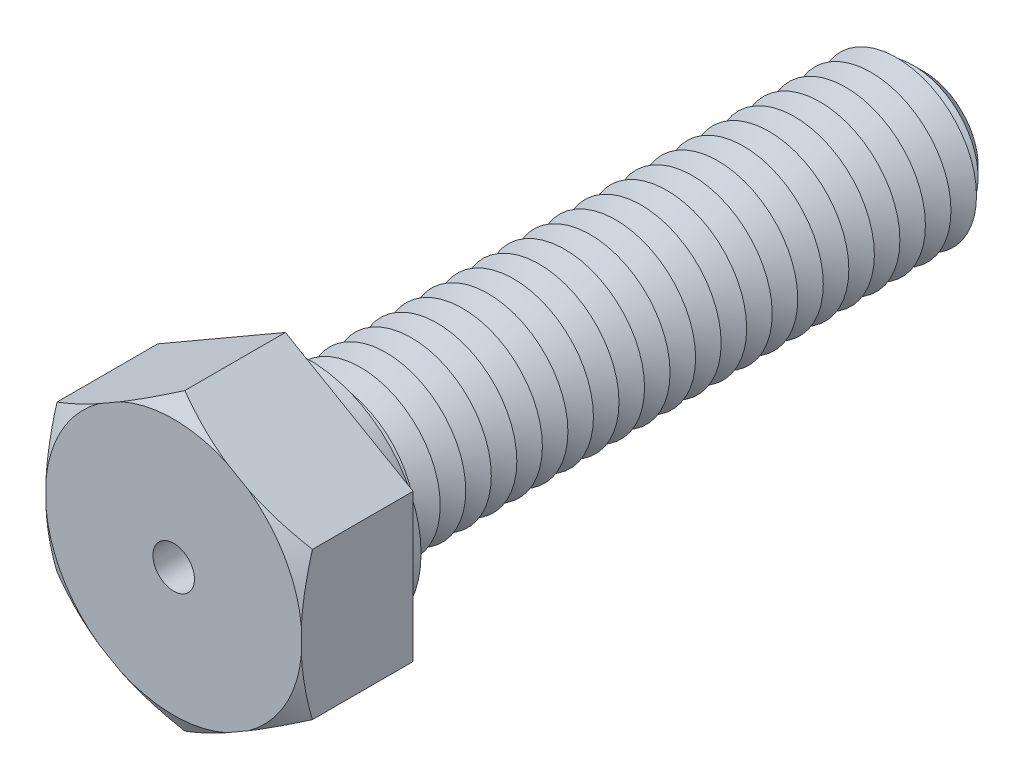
ISO-10303-21;
HEADER;
FILE_DESCRIPTION(('STEP AP214'),'2;1');
FILE_NAME('part.step','',(''),(''),'','','');
FILE_SCHEMA(('AUTOMOTIVE_DESIGN { 1 0 10303 214 1 1 1 1 }'));
ENDSEC;
DATA;
#1=APPLICATION_CONTEXT('core data for automotive mechanical design processes');
#2=APPLICATION_PROTOCOL_DEFINITION('international standard','automotive_design',2000,#1);
#3=PRODUCT_CONTEXT('',#1,'mechanical');
#4=PRODUCT('Part','Part','',(#3));
#5=PRODUCT_RELATED_PRODUCT_CATEGORY('part','',(#4));
#6=PRODUCT_DEFINITION_FORMATION('','',#4);
#7=PRODUCT_DEFINITION_CONTEXT('part definition',#1,'design');
#8=PRODUCT_DEFINITION('design','',#6,#7);
#9=PRODUCT_DEFINITION_SHAPE('','',#8);
#10=(LENGTH_UNIT() NAMED_UNIT(*) SI_UNIT(.MILLI.,.METRE.));
#11=(NAMED_UNIT(*) PLANE_ANGLE_UNIT() SI_UNIT($,.RADIAN.));
#12=(NAMED_UNIT(*) SI_UNIT($,.STERADIAN.) SOLID_ANGLE_UNIT());
#13=UNCERTAINTY_MEASURE_WITH_UNIT(LENGTH_MEASURE(1.E-05),#10,'distance_accuracy_value','');
#14=(GEOMETRIC_REPRESENTATION_CONTEXT(3) GLOBAL_UNCERTAINTY_ASSIGNED_CONTEXT((#13)) GLOBAL_UNIT_ASSIGNED_CONTEXT((#10,
#11,#12)) REPRESENTATION_CONTEXT('',''));
#15=CARTESIAN_POINT('',(0.,0.,0.));
#16=DIRECTION('',(0.,0.,1.));
#17=DIRECTION('',(1.,0.,0.));
#18=AXIS2_PLACEMENT_3D('',#15,#16,#17);
#19=CARTESIAN_POINT('',(4.,2.3094010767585,3.5));
#20=DIRECTION('',(-0.5,-0.866025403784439,0.));
#21=DIRECTION('',(0.866025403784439,-0.5,0.));
#22=AXIS2_PLACEMENT_3D('',#19,#20,#21);
#23=PLANE('',#22);
#24=CARTESIAN_POINT('',(6.77926459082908,0.704791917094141,1.88515125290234));
#25=CARTESIAN_POINT('',(6.65357706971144,0.777357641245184,1.95298106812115));
#26=CARTESIAN_POINT('',(6.52758896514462,0.850096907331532,2.02007962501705));
#27=CARTESIAN_POINT('',(6.2748848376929,0.995995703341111,2.15247084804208));
#28=CARTESIAN_POINT('',(6.14816872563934,1.06915528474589,2.21776328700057));
#29=CARTESIAN_POINT('',(5.8935057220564,1.21618503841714,2.34638757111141));
#30=CARTESIAN_POINT('',(5.76555618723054,1.29005673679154,2.40971246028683));
#31=CARTESIAN_POINT('',(5.50869902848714,1.43835328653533,2.53371033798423));
#32=CARTESIAN_POINT('',(5.37979143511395,1.51277812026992,2.59438341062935));
#33=CARTESIAN_POINT('',(5.11756014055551,1.66417742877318,2.7140043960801));
#34=CARTESIAN_POINT('',(4.98420771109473,1.74116848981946,2.77286873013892));
#35=CARTESIAN_POINT('',(4.7161724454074,1.89591872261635,2.88640197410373));
#36=CARTESIAN_POINT('',(4.58148968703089,1.97367784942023,2.94107112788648));
#37=CARTESIAN_POINT('',(4.31074083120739,2.12999477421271,3.0451841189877));
#38=CARTESIAN_POINT('',(4.17467611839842,2.20855177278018,3.09463271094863));
#39=CARTESIAN_POINT('',(3.90094921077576,2.36658807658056,3.18716064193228));
#40=CARTESIAN_POINT('',(3.76328722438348,2.44606726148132,3.23024080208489));
#41=CARTESIAN_POINT('',(3.43409497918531,2.63612649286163,3.32342391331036));
#42=CARTESIAN_POINT('',(3.24179802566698,2.74714919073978,3.37006382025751));
#43=CARTESIAN_POINT('',(2.95137883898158,2.91482278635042,3.4261412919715));
#44=CARTESIAN_POINT('',(2.85424512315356,2.97090296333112,3.44251989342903));
#45=CARTESIAN_POINT('',(2.65944416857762,3.08337134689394,3.47023794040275));
#46=CARTESIAN_POINT('',(2.56177700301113,3.13975951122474,3.48157806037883));
#47=CARTESIAN_POINT('',(2.36721602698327,3.25208934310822,3.49879538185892));
#48=CARTESIAN_POINT('',(2.27032632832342,3.30802863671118,3.50473421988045));
#49=CARTESIAN_POINT('',(2.07641108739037,3.41998565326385,3.51119583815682));
#50=CARTESIAN_POINT('',(1.97938554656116,3.47600337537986,3.51171867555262));
#51=CARTESIAN_POINT('',(1.78542763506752,3.58798502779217,3.50733170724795));
#52=CARTESIAN_POINT('',(1.68849526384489,3.64394895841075,3.50242193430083));
#53=CARTESIAN_POINT('',(1.49492986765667,3.75570399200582,3.48731840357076));
#54=CARTESIAN_POINT('',(1.39829689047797,3.81149506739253,3.47712384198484));
#55=CARTESIAN_POINT('',(1.1701117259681,3.94323783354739,3.44706969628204));
#56=CARTESIAN_POINT('',(1.03877271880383,4.01906644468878,3.42503535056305));
#57=CARTESIAN_POINT('',(0.777349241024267,4.16999935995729,3.37264454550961));
#58=CARTESIAN_POINT('',(0.64726495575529,4.24510355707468,3.34228687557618));
#59=CARTESIAN_POINT('',(0.388367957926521,4.3945778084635,3.27439527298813));
#60=CARTESIAN_POINT('',(0.259556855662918,4.46894693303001,3.2368532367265));
#61=CARTESIAN_POINT('',(0.00337956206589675,4.61685096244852,3.15577578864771));
#62=CARTESIAN_POINT('',(-0.123986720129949,4.69038591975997,3.11224075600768));
#63=CARTESIAN_POINT('',(-0.378873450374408,4.83754484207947,3.01966290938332));
#64=CARTESIAN_POINT('',(-0.506377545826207,4.91115936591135,2.97056048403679));
#65=CARTESIAN_POINT('',(-0.760034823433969,5.0576084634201,2.86822484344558));
#66=CARTESIAN_POINT('',(-0.886188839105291,5.13044351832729,2.81499436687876));
#67=CARTESIAN_POINT('',(-1.13734672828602,5.27544959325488,2.70513446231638));
#68=CARTESIAN_POINT('',(-1.26235083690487,5.34762074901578,2.6485057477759));
#69=CARTESIAN_POINT('',(-1.5113783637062,5.49139685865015,2.53244390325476));
#70=CARTESIAN_POINT('',(-1.63540176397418,5.56300180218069,2.47301072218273));
#71=CARTESIAN_POINT('',(-1.84520240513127,5.68413025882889,2.37015667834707));
#72=CARTESIAN_POINT('',(-1.93119941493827,5.73378065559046,2.32733101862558));
#73=CARTESIAN_POINT('',(-2.1028145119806,5.83286267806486,2.24068817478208));
#74=CARTESIAN_POINT('',(-2.18843261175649,5.88229431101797,2.19687102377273));
#75=CARTESIAN_POINT('',(-2.3584228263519,5.98043820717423,2.10883190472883));
#76=CARTESIAN_POINT('',(-2.44279852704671,6.02915254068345,2.06461915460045));
#77=CARTESIAN_POINT('',(-2.61124951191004,6.12640776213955,1.97543229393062));
#78=CARTESIAN_POINT('',(-2.6953247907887,6.17494864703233,1.93045817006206));
#79=CARTESIAN_POINT('',(-2.77926459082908,6.22341131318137,1.88515125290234));
#80=B_SPLINE_CURVE_WITH_KNOTS('',3,(#24,#25,#26,#27,#28,#29,#30,#31,#32,#33,#34,#35,#36,#37,#38,
#39,#40,#41,#42,#43,#44,#45,#46,#47,#48,#49,#50,#51,#52,#53,#54,#55,#56,#57,#58,#59,#60,#61,#62,
#63,#64,#65,#66,#67,#68,#69,#70,#71,#72,#73,#74,#75,#76,#77,#78,#79),.UNSPECIFIED.,.F.,.F.,(4,2,
2,2,2,2,2,2,2,2,2,2,2,2,2,2,2,2,2,2,2,2,2,2,2,2,2,4),(0.,0.480604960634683,0.96127009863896,
1.44347608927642,1.92566677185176,2.42016676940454,2.91463799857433,3.4086549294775,
3.9026081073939,4.58254272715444,4.92249867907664,5.26240911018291,5.59839013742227,
5.93436761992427,6.27034307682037,6.60636964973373,7.06584039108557,7.52537799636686,
7.98543702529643,8.44546695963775,8.91099531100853,9.37621741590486,9.84134218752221,
10.3064754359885,10.6308960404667,10.9553058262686,11.2762760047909,11.5972518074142),.UNSPECIFIED.);
#81=CARTESIAN_POINT('',(4.,2.3094010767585,3.15358983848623));
#82=VERTEX_POINT('',#81);
#83=CARTESIAN_POINT('',(2.33627081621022,3.26995556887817,3.5));
#84=VERTEX_POINT('',#83);
#85=EDGE_CURVE('E132',#82,#84,#80,.T.);
#86=ORIENTED_EDGE('',*,*,#85,.F.);
#87=DIRECTION('',(0.,0.,-1.));
#88=VECTOR('',#87,1.);
#89=CARTESIAN_POINT('',(4.,2.3094010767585,3.5));
#90=LINE('',#89,#88);
#91=CARTESIAN_POINT('',(4.,2.3094010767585,0.));
#92=VERTEX_POINT('',#91);
#93=EDGE_CURVE('E144',#82,#92,#90,.T.);
#94=ORIENTED_EDGE('',*,*,#93,.T.);
#95=DIRECTION('',(-0.866025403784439,0.5,0.));
#96=VECTOR('',#95,1.);
#97=CARTESIAN_POINT('',(4.,2.3094010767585,0.));
#98=LINE('',#97,#96);
#99=CARTESIAN_POINT('',(0.,4.618802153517,0.));
#100=VERTEX_POINT('',#99);
#101=EDGE_CURVE('E395',#92,#100,#98,.T.);
#102=ORIENTED_EDGE('',*,*,#101,.T.);
#103=DIRECTION('',(0.,0.,-1.));
#104=VECTOR('',#103,1.);
#105=CARTESIAN_POINT('',(0.,4.618802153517,3.5));
#106=LINE('',#105,#104);
#107=CARTESIAN_POINT('',(0.,4.61880215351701,3.15358983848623));
#108=VERTEX_POINT('',#107);
#109=EDGE_CURVE('E179',#108,#100,#106,.T.);
#110=ORIENTED_EDGE('',*,*,#109,.F.);
#111=CARTESIAN_POINT('',(1.66372918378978,3.65824766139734,3.5));
#112=VERTEX_POINT('',#111);
#113=EDGE_CURVE('E151',#112,#108,#80,.T.);
#114=ORIENTED_EDGE('',*,*,#113,.F.);
#115=DIRECTION('',(-0.866025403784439,0.5,0.));
#116=VECTOR('',#115,1.);
#117=CARTESIAN_POINT('',(4.,2.3094010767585,3.5));
#118=LINE('',#117,#116);
#119=EDGE_CURVE('E148',#84,#112,#118,.T.);
#120=ORIENTED_EDGE('',*,*,#119,.F.);
#121=EDGE_LOOP('',(#86,#94,#102,#110,#114,#120));
#122=FACE_BOUND('',#121,.T.);
#123=ADVANCED_FACE('F39',(#122),#23,.F.);
#124=CARTESIAN_POINT('',(0.,4.618802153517,3.5));
#125=DIRECTION('',(0.5,-0.866025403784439,0.));
#126=DIRECTION('',(0.866025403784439,0.5,0.));
#127=AXIS2_PLACEMENT_3D('',#124,#125,#126);
#128=PLANE('',#127);
#129=CARTESIAN_POINT('',(2.77926459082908,6.22341131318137,1.88515125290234));
#130=CARTESIAN_POINT('',(2.65357706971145,6.15084558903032,1.95298106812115));
#131=CARTESIAN_POINT('',(2.52758896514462,6.07810632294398,2.02007962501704));
#132=CARTESIAN_POINT('',(2.2748848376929,5.9322075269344,2.15247084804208));
#133=CARTESIAN_POINT('',(2.14816872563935,5.85904794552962,2.21776328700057));
#134=CARTESIAN_POINT('',(1.89350572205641,5.71201819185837,2.3463875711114));
#135=CARTESIAN_POINT('',(1.76555618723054,5.63814649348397,2.40971246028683));
#136=CARTESIAN_POINT('',(1.50869902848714,5.48984994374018,2.53371033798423));
#137=CARTESIAN_POINT('',(1.37979143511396,5.41542511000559,2.59438341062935));
#138=CARTESIAN_POINT('',(1.11756014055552,5.26402580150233,2.7140043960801));
#139=CARTESIAN_POINT('',(0.984207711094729,5.18703474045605,2.77286873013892));
#140=CARTESIAN_POINT('',(0.716172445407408,5.03228450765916,2.88640197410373));
#141=CARTESIAN_POINT('',(0.581489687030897,4.95452538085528,2.94107112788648));
#142=CARTESIAN_POINT('',(0.310740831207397,4.7982084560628,3.0451841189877));
#143=CARTESIAN_POINT('',(0.174676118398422,4.71965145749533,3.09463271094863));
#144=CARTESIAN_POINT('',(-0.0990507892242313,4.56161515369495,3.18716064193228));
#145=CARTESIAN_POINT('',(-0.236712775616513,4.48213596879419,3.23024080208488));
#146=CARTESIAN_POINT('',(-0.565905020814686,4.29207673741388,3.32342391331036));
#147=CARTESIAN_POINT('',(-0.758201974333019,4.18105403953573,3.37006382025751));
#148=CARTESIAN_POINT('',(-1.04862116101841,4.01338044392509,3.4261412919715));
#149=CARTESIAN_POINT('',(-1.14575487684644,3.95730026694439,3.44251989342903));
#150=CARTESIAN_POINT('',(-1.34055583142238,3.84483188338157,3.47023794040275));
#151=CARTESIAN_POINT('',(-1.43822299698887,3.78844371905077,3.48157806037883));
#152=CARTESIAN_POINT('',(-1.63278397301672,3.67611388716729,3.49879538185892));
#153=CARTESIAN_POINT('',(-1.72967367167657,3.62017459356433,3.50473421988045));
#154=CARTESIAN_POINT('',(-1.92358891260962,3.50821757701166,3.51119583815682));
#155=CARTESIAN_POINT('',(-2.02061445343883,3.45219985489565,3.51171867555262));
#156=CARTESIAN_POINT('',(-2.21457236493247,3.34021820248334,3.50733170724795));
#157=CARTESIAN_POINT('',(-2.3115047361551,3.28425427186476,3.50242193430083));
#158=CARTESIAN_POINT('',(-2.50507013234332,3.1724992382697,3.48731840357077));
#159=CARTESIAN_POINT('',(-2.60170310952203,3.11670816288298,3.47712384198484));
#160=CARTESIAN_POINT('',(-2.82988827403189,2.98496539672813,3.44706969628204));
#161=CARTESIAN_POINT('',(-2.96122728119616,2.90913678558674,3.42503535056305));
#162=CARTESIAN_POINT('',(-3.22265075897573,2.75820387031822,3.37264454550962));
#163=CARTESIAN_POINT('',(-3.3527350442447,2.68309967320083,3.34228687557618));
#164=CARTESIAN_POINT('',(-3.61163204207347,2.53362542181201,3.27439527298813));
#165=CARTESIAN_POINT('',(-3.74044314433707,2.4592562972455,3.23685323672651));
#166=CARTESIAN_POINT('',(-3.99662043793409,2.311352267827,3.15577578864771));
#167=CARTESIAN_POINT('',(-4.12398672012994,2.23781731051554,3.11224075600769));
#168=CARTESIAN_POINT('',(-4.3788734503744,2.09065838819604,3.01966290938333));
#169=CARTESIAN_POINT('',(-4.5063775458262,2.01704386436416,2.97056048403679));
#170=CARTESIAN_POINT('',(-4.76003482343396,1.87059476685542,2.86822484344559));
#171=CARTESIAN_POINT('',(-4.88618883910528,1.79775971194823,2.81499436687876));
#172=CARTESIAN_POINT('',(-5.13734672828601,1.65275363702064,2.70513446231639));
#173=CARTESIAN_POINT('',(-5.26235083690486,1.58058248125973,2.64850574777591));
#174=CARTESIAN_POINT('',(-5.51137836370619,1.43680637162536,2.53244390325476));
#175=CARTESIAN_POINT('',(-5.63540176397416,1.36520142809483,2.47301072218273));
#176=CARTESIAN_POINT('',(-5.84520240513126,1.24407297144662,2.37015667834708));
#177=CARTESIAN_POINT('',(-5.93119941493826,1.19442257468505,2.32733101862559));
#178=CARTESIAN_POINT('',(-6.1028145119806,1.09534055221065,2.24068817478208));
#179=CARTESIAN_POINT('',(-6.18843261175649,1.04590891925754,2.19687102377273));
#180=CARTESIAN_POINT('',(-6.3584228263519,0.947765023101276,2.10883190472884));
#181=CARTESIAN_POINT('',(-6.44279852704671,0.899050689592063,2.06461915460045));
#182=CARTESIAN_POINT('',(-6.61124951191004,0.80179546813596,1.97543229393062));
#183=CARTESIAN_POINT('',(-6.6953247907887,0.753254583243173,1.93045817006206));
#184=CARTESIAN_POINT('',(-6.77926459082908,0.704791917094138,1.88515125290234));
#185=B_SPLINE_CURVE_WITH_KNOTS('',3,(#129,#130,#131,#132,#133,#134,#135,#136,#137,#138,#139,
#140,#141,#142,#143,#144,#145,#146,#147,#148,#149,#150,#151,#152,#153,#154,#155,#156,#157,#158,
#159,#160,#161,#162,#163,#164,#165,#166,#167,#168,#169,#170,#171,#172,#173,#174,#175,#176,#177,
#178,#179,#180,#181,#182,#183,#184),.UNSPECIFIED.,.F.,.F.,(4,2,2,2,2,2,2,2,2,2,2,2,2,2,2,2,2,2,
2,2,2,2,2,2,2,2,2,4),(0.,0.480604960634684,0.961270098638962,1.44347608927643,1.92566677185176,
2.42016676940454,2.91463799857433,3.4086549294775,3.9026081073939,4.58254272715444,
4.92249867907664,5.26240911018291,5.59839013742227,5.93436761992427,6.27034307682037,
6.60636964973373,7.06584039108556,7.52537799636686,7.98543702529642,8.44546695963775,
8.91099531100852,9.37621741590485,9.8413421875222,10.3064754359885,10.6308960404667,
10.9553058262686,11.2762760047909,11.5972518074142),.UNSPECIFIED.);
#186=CARTESIAN_POINT('',(-1.66372918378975,3.65824766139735,3.5));
#187=VERTEX_POINT('',#186);
#188=EDGE_CURVE('E438',#108,#187,#185,.T.);
#189=ORIENTED_EDGE('',*,*,#188,.F.);
#190=ORIENTED_EDGE('',*,*,#109,.T.);
#191=DIRECTION('',(-0.866025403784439,-0.5,0.));
#192=VECTOR('',#191,1.);
#193=CARTESIAN_POINT('',(0.,4.618802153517,0.));
#194=LINE('',#193,#192);
#195=CARTESIAN_POINT('',(-4.,2.3094010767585,0.));
#196=VERTEX_POINT('',#195);
#197=EDGE_CURVE('E413',#100,#196,#194,.T.);
#198=ORIENTED_EDGE('',*,*,#197,.T.);
#199=DIRECTION('',(0.,0.,-1.));
#200=VECTOR('',#199,1.);
#201=CARTESIAN_POINT('',(-4.,2.3094010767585,3.5));
#202=LINE('',#201,#200);
#203=CARTESIAN_POINT('',(-4.,2.3094010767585,3.15358983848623));
#204=VERTEX_POINT('',#203);
#205=EDGE_CURVE('E176',#204,#196,#202,.T.);
#206=ORIENTED_EDGE('',*,*,#205,.F.);
#207=CARTESIAN_POINT('',(-2.33627081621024,3.26995556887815,3.5));
#208=VERTEX_POINT('',#207);
#209=EDGE_CURVE('E437',#208,#204,#185,.T.);
#210=ORIENTED_EDGE('',*,*,#209,.F.);
#211=DIRECTION('',(-0.866025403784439,-0.5,0.));
#212=VECTOR('',#211,1.);
#213=CARTESIAN_POINT('',(0.,4.618802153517,3.5));
#214=LINE('',#213,#212);
#215=EDGE_CURVE('E398',#187,#208,#214,.T.);
#216=ORIENTED_EDGE('',*,*,#215,.F.);
#217=EDGE_LOOP('',(#189,#190,#198,#206,#210,#216));
#218=FACE_BOUND('',#217,.T.);
#219=ADVANCED_FACE('F509',(#218),#128,.F.);
#220=CARTESIAN_POINT('',(-4.,2.3094010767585,3.5));
#221=DIRECTION('',(1.,0.,0.));
#222=DIRECTION('',(0.,0.,-1.));
#223=AXIS2_PLACEMENT_3D('',#220,#221,#222);
#224=PLANE('',#223);
#225=CARTESIAN_POINT('',(-4.,5.08866566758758,2.08330060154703));
#226=CARTESIAN_POINT('',(-4.,4.94414615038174,2.14888120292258));
#227=CARTESIAN_POINT('',(-4.,4.79923170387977,2.21360759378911));
#228=CARTESIAN_POINT('',(-4.,4.5084433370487,2.34093771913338));
#229=CARTESIAN_POINT('',(-4.,4.36256924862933,2.4035410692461));
#230=CARTESIAN_POINT('',(-4.,4.06913305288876,2.52644280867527));
#231=CARTESIAN_POINT('',(-4.,3.92156644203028,2.58673049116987));
#232=CARTESIAN_POINT('',(-4.,3.62518774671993,2.70415001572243));
#233=CARTESIAN_POINT('',(-4.,3.47637571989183,2.76128200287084));
#234=CARTESIAN_POINT('',(-4.,3.17798204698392,2.87144502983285));
#235=CARTESIAN_POINT('',(-4.,3.02840679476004,2.92449322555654));
#236=CARTESIAN_POINT('',(-4.,2.72767549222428,3.02589725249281));
#237=CARTESIAN_POINT('',(-4.,2.57651933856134,3.07425277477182));
#238=CARTESIAN_POINT('',(-4.,2.12084922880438,3.21062944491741));
#239=CARTESIAN_POINT('',(-4.,1.81364350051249,3.29014850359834));
#240=CARTESIAN_POINT('',(-4.,1.28033133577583,3.39840613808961));
#241=CARTESIAN_POINT('',(-4.,1.05588972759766,3.43514774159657));
#242=CARTESIAN_POINT('',(-4.,0.717455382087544,3.47487260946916));
#243=CARTESIAN_POINT('',(-4.,0.604348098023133,3.48554965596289));
#244=CARTESIAN_POINT('',(-4.,0.377758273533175,3.50148677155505));
#245=CARTESIAN_POINT('',(-4.,0.264275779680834,3.50674748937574));
#246=CARTESIAN_POINT('',(-4.,0.0372413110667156,3.51168400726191));
#247=CARTESIAN_POINT('',(-4.,-0.0763106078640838,3.51136237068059));
#248=CARTESIAN_POINT('',(-4.,-0.303259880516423,3.50515259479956));
#249=CARTESIAN_POINT('',(-4.,-0.416657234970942,3.49926448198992));
#250=CARTESIAN_POINT('',(-4.,-0.643045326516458,3.48210091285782));
#251=CARTESIAN_POINT('',(-4.,-0.756036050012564,3.47082527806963));
#252=CARTESIAN_POINT('',(-4.,-0.981405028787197,3.44321260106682));
#253=CARTESIAN_POINT('',(-4.,-1.09378317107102,3.42687465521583));
#254=CARTESIAN_POINT('',(-4.,-1.54188975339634,3.35219605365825));
#255=CARTESIAN_POINT('',(-4.,-1.87460189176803,3.27522286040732));
#256=CARTESIAN_POINT('',(-4.,-2.36751874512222,3.1379521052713));
#257=CARTESIAN_POINT('',(-4.,-2.53101356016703,3.08847923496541));
#258=CARTESIAN_POINT('',(-4.,-2.85611626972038,2.98363580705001));
#259=CARTESIAN_POINT('',(-4.,-3.01772429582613,2.92826566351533));
#260=CARTESIAN_POINT('',(-4.,-3.34106601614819,2.81212836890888));
#261=CARTESIAN_POINT('',(-4.,-3.50277978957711,2.75130648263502));
#262=CARTESIAN_POINT('',(-4.,-3.82469686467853,2.62576992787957));
#263=CARTESIAN_POINT('',(-4.,-3.98490007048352,2.56105501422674));
#264=CARTESIAN_POINT('',(-4.,-4.30300593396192,2.4289095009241));
#265=CARTESIAN_POINT('',(-4.,-4.46091670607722,2.36149833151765));
#266=CARTESIAN_POINT('',(-4.,-4.7755935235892,2.22415533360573));
#267=CARTESIAN_POINT('',(-4.,-4.93235984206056,2.15422413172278));
#268=CARTESIAN_POINT('',(-4.,-5.08866566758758,2.08330060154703));
#269=B_SPLINE_CURVE_WITH_KNOTS('',3,(#225,#226,#227,#228,#229,#230,#231,#232,#233,#234,#235,
#236,#237,#238,#239,#240,#241,#242,#243,#244,#245,#246,#247,#248,#249,#250,#251,#252,#253,#254,
#255,#256,#257,#258,#259,#260,#261,#262,#263,#264,#265,#266,#267,#268),.UNSPECIFIED.,.F.,.F.,(4,
2,2,2,2,2,2,2,2,2,2,2,2,2,2,2,2,2,2,2,2,4),(0.,0.476116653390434,0.952319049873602,
1.43050831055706,1.90867556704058,2.38470991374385,2.8607755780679,3.81133518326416,
4.49276221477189,4.83347879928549,5.17415457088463,5.51467391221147,5.85519163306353,
6.19572063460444,6.53631045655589,7.5583874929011,8.07079781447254,8.58317218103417,
9.1014378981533,9.61973628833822,10.1348057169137,10.6497479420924),.UNSPECIFIED.);
#270=CARTESIAN_POINT('',(-4.,0.388292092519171,3.5));
#271=VERTEX_POINT('',#270);
#272=EDGE_CURVE('E439',#204,#271,#269,.T.);
#273=ORIENTED_EDGE('',*,*,#272,.F.);
#274=ORIENTED_EDGE('',*,*,#205,.T.);
#275=DIRECTION('',(0.,-1.,0.));
#276=VECTOR('',#275,1.);
#277=CARTESIAN_POINT('',(-4.,2.3094010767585,0.));
#278=LINE('',#277,#276);
#279=CARTESIAN_POINT('',(-4.,-2.3094010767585,0.));
#280=VERTEX_POINT('',#279);
#281=EDGE_CURVE('E417',#196,#280,#278,.T.);
#282=ORIENTED_EDGE('',*,*,#281,.T.);
#283=DIRECTION('',(0.,0.,-1.));
#284=VECTOR('',#283,1.);
#285=CARTESIAN_POINT('',(-4.,-2.3094010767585,3.5));
#286=LINE('',#285,#284);
#287=CARTESIAN_POINT('',(-4.,-2.30940107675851,3.15358983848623));
#288=VERTEX_POINT('',#287);
#289=EDGE_CURVE('E173',#288,#280,#286,.T.);
#290=ORIENTED_EDGE('',*,*,#289,.F.);
#291=CARTESIAN_POINT('',(-4.,-0.388292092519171,3.5));
#292=VERTEX_POINT('',#291);
#293=EDGE_CURVE('E446',#292,#288,#269,.T.);
#294=ORIENTED_EDGE('',*,*,#293,.F.);
#295=DIRECTION('',(0.,-1.,0.));
#296=VECTOR('',#295,1.);
#297=CARTESIAN_POINT('',(-4.,2.3094010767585,3.5));
#298=LINE('',#297,#296);
#299=EDGE_CURVE('E401',#271,#292,#298,.T.);
#300=ORIENTED_EDGE('',*,*,#299,.F.);
#301=EDGE_LOOP('',(#273,#274,#282,#290,#294,#300));
#302=FACE_BOUND('',#301,.T.);
#303=ADVANCED_FACE('F468',(#302),#224,.F.);
#304=CARTESIAN_POINT('',(-4.,-2.3094010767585,3.5));
#305=DIRECTION('',(0.5,0.866025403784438,0.));
#306=DIRECTION('',(-0.866025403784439,0.5,0.));
#307=AXIS2_PLACEMENT_3D('',#304,#305,#306);
#308=PLANE('',#307);
#309=CARTESIAN_POINT('',(-6.77926459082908,-0.704791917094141,1.88515125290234));
#310=CARTESIAN_POINT('',(-6.65357706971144,-0.777357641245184,1.95298106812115));
#311=CARTESIAN_POINT('',(-6.52758896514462,-0.850096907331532,2.02007962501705));
#312=CARTESIAN_POINT('',(-6.2748848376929,-0.995995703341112,2.15247084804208));
#313=CARTESIAN_POINT('',(-6.14816872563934,-1.06915528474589,2.21776328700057));
#314=CARTESIAN_POINT('',(-5.8935057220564,-1.21618503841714,2.34638757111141));
#315=CARTESIAN_POINT('',(-5.76555618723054,-1.29005673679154,2.40971246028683));
#316=CARTESIAN_POINT('',(-5.50869902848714,-1.43835328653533,2.53371033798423));
#317=CARTESIAN_POINT('',(-5.37979143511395,-1.51277812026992,2.59438341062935));
#318=CARTESIAN_POINT('',(-5.11756014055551,-1.66417742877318,2.71400439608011));
#319=CARTESIAN_POINT('',(-4.98420771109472,-1.74116848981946,2.77286873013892));
#320=CARTESIAN_POINT('',(-4.7161724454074,-1.89591872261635,2.88640197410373));
#321=CARTESIAN_POINT('',(-4.58148968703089,-1.97367784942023,2.94107112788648));
#322=CARTESIAN_POINT('',(-4.31074083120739,-2.12999477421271,3.0451841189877));
#323=CARTESIAN_POINT('',(-4.17467611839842,-2.20855177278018,3.09463271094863));
#324=CARTESIAN_POINT('',(-3.90094921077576,-2.36658807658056,3.18716064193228));
#325=CARTESIAN_POINT('',(-3.76328722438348,-2.44606726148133,3.23024080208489));
#326=CARTESIAN_POINT('',(-3.43409497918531,-2.63612649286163,3.32342391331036));
#327=CARTESIAN_POINT('',(-3.24179802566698,-2.74714919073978,3.3700638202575));
#328=CARTESIAN_POINT('',(-2.95137883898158,-2.91482278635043,3.4261412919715));
#329=CARTESIAN_POINT('',(-2.85424512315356,-2.97090296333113,3.44251989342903));
#330=CARTESIAN_POINT('',(-2.65944416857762,-3.08337134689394,3.47023794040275));
#331=CARTESIAN_POINT('',(-2.56177700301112,-3.13975951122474,3.48157806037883));
#332=CARTESIAN_POINT('',(-2.36721602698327,-3.25208934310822,3.49879538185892));
#333=CARTESIAN_POINT('',(-2.27032632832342,-3.30802863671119,3.50473421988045));
#334=CARTESIAN_POINT('',(-2.07641108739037,-3.41998565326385,3.51119583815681));
#335=CARTESIAN_POINT('',(-1.97938554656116,-3.47600337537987,3.51171867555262));
#336=CARTESIAN_POINT('',(-1.78542763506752,-3.58798502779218,3.50733170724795));
#337=CARTESIAN_POINT('',(-1.68849526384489,-3.64394895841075,3.50242193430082));
#338=CARTESIAN_POINT('',(-1.49492986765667,-3.75570399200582,3.48731840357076));
#339=CARTESIAN_POINT('',(-1.39829689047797,-3.81149506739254,3.47712384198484));
#340=CARTESIAN_POINT('',(-1.1701117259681,-3.94323783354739,3.44706969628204));
#341=CARTESIAN_POINT('',(-1.03877271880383,-4.01906644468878,3.42503535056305));
#342=CARTESIAN_POINT('',(-0.777349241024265,-4.1699993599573,3.37264454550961));
#343=CARTESIAN_POINT('',(-0.647264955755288,-4.24510355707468,3.34228687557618));
#344=CARTESIAN_POINT('',(-0.388367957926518,-4.39457780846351,3.27439527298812));
#345=CARTESIAN_POINT('',(-0.259556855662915,-4.46894693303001,3.2368532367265));
#346=CARTESIAN_POINT('',(-0.00337956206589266,-4.61685096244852,3.1557757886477));
#347=CARTESIAN_POINT('',(0.123986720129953,-4.69038591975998,3.11224075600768));
#348=CARTESIAN_POINT('',(0.378873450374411,-4.83754484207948,3.01966290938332));
#349=CARTESIAN_POINT('',(0.50637754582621,-4.91115936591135,2.97056048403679));
#350=CARTESIAN_POINT('',(0.760034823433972,-5.0576084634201,2.86822484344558));
#351=CARTESIAN_POINT('',(0.886188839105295,-5.13044351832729,2.81499436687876));
#352=CARTESIAN_POINT('',(1.13734672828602,-5.27544959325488,2.70513446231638));
#353=CARTESIAN_POINT('',(1.26235083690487,-5.34762074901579,2.6485057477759));
#354=CARTESIAN_POINT('',(1.5113783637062,-5.49139685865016,2.53244390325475));
#355=CARTESIAN_POINT('',(1.63540176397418,-5.56300180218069,2.47301072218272));
#356=CARTESIAN_POINT('',(1.84520240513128,-5.6841302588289,2.37015667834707));
#357=CARTESIAN_POINT('',(1.93119941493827,-5.73378065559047,2.32733101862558));
#358=CARTESIAN_POINT('',(2.10281451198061,-5.83286267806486,2.24068817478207));
#359=CARTESIAN_POINT('',(2.1884326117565,-5.88229431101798,2.19687102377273));
#360=CARTESIAN_POINT('',(2.3584228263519,-5.98043820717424,2.10883190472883));
#361=CARTESIAN_POINT('',(2.44279852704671,-6.02915254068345,2.06461915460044));
#362=CARTESIAN_POINT('',(2.61124951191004,-6.12640776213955,1.97543229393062));
#363=CARTESIAN_POINT('',(2.6953247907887,-6.17494864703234,1.93045817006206));
#364=CARTESIAN_POINT('',(2.77926459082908,-6.22341131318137,1.88515125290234));
#365=B_SPLINE_CURVE_WITH_KNOTS('',3,(#309,#310,#311,#312,#313,#314,#315,#316,#317,#318,#319,
#320,#321,#322,#323,#324,#325,#326,#327,#328,#329,#330,#331,#332,#333,#334,#335,#336,#337,#338,
#339,#340,#341,#342,#343,#344,#345,#346,#347,#348,#349,#350,#351,#352,#353,#354,#355,#356,#357,
#358,#359,#360,#361,#362,#363,#364),.UNSPECIFIED.,.F.,.F.,(4,2,2,2,2,2,2,2,2,2,2,2,2,2,2,2,2,2,
2,2,2,2,2,2,2,2,2,4),(0.,0.480604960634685,0.961270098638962,1.44347608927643,1.92566677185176,
2.42016676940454,2.91463799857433,3.4086549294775,3.90260810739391,4.58254272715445,
4.92249867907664,5.26240911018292,5.59839013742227,5.93436761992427,6.27034307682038,
6.60636964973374,7.06584039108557,7.52537799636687,7.98543702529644,8.44546695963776,
8.91099531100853,9.37621741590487,9.84134218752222,10.3064754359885,10.6308960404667,
10.9553058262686,11.2762760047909,11.5972518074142),.UNSPECIFIED.);
#366=CARTESIAN_POINT('',(-2.3362708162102,-3.26995556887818,3.5));
#367=VERTEX_POINT('',#366);
#368=EDGE_CURVE('E445',#288,#367,#365,.T.);
#369=ORIENTED_EDGE('',*,*,#368,.F.);
#370=ORIENTED_EDGE('',*,*,#289,.T.);
#371=DIRECTION('',(0.866025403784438,-0.5,0.));
#372=VECTOR('',#371,1.);
#373=CARTESIAN_POINT('',(-4.,-2.3094010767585,0.));
#374=LINE('',#373,#372);
#375=CARTESIAN_POINT('',(0.,-4.61880215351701,0.));
#376=VERTEX_POINT('',#375);
#377=EDGE_CURVE('E421',#280,#376,#374,.T.);
#378=ORIENTED_EDGE('',*,*,#377,.T.);
#379=DIRECTION('',(0.,0.,-1.));
#380=VECTOR('',#379,1.);
#381=CARTESIAN_POINT('',(0.,-4.61880215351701,3.5));
#382=LINE('',#381,#380);
#383=CARTESIAN_POINT('',(0.,-4.618802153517,3.15358983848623));
#384=VERTEX_POINT('',#383);
#385=EDGE_CURVE('E163',#384,#376,#382,.T.);
#386=ORIENTED_EDGE('',*,*,#385,.F.);
#387=CARTESIAN_POINT('',(-1.6637291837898,-3.65824766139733,3.5));
#388=VERTEX_POINT('',#387);
#389=EDGE_CURVE('E441',#388,#384,#365,.T.);
#390=ORIENTED_EDGE('',*,*,#389,.F.);
#391=DIRECTION('',(0.866025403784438,-0.5,0.));
#392=VECTOR('',#391,1.);
#393=CARTESIAN_POINT('',(-4.,-2.3094010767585,3.5));
#394=LINE('',#393,#392);
#395=EDGE_CURVE('E405',#367,#388,#394,.T.);
#396=ORIENTED_EDGE('',*,*,#395,.F.);
#397=EDGE_LOOP('',(#369,#370,#378,#386,#390,#396));
#398=FACE_BOUND('',#397,.T.);
#399=ADVANCED_FACE('F500',(#398),#308,.F.);
#400=CARTESIAN_POINT('',(0.,-4.61880215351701,3.5));
#401=DIRECTION('',(-0.5,0.866025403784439,0.));
#402=DIRECTION('',(-0.866025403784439,-0.5,0.));
#403=AXIS2_PLACEMENT_3D('',#400,#401,#402);
#404=PLANE('',#403);
#405=CARTESIAN_POINT('',(-2.77926459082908,-6.22341131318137,1.88515125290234));
#406=CARTESIAN_POINT('',(-2.65357706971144,-6.15084558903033,1.95298106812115));
#407=CARTESIAN_POINT('',(-2.52758896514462,-6.07810632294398,2.02007962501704));
#408=CARTESIAN_POINT('',(-2.2748848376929,-5.9322075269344,2.15247084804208));
#409=CARTESIAN_POINT('',(-2.14816872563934,-5.85904794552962,2.21776328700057));
#410=CARTESIAN_POINT('',(-1.8935057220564,-5.71201819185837,2.3463875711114));
#411=CARTESIAN_POINT('',(-1.76555618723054,-5.63814649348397,2.40971246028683));
#412=CARTESIAN_POINT('',(-1.50869902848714,-5.48984994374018,2.53371033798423));
#413=CARTESIAN_POINT('',(-1.37979143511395,-5.41542511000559,2.59438341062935));
#414=CARTESIAN_POINT('',(-1.11756014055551,-5.26402580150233,2.7140043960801));
#415=CARTESIAN_POINT('',(-0.984207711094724,-5.18703474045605,2.77286873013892));
#416=CARTESIAN_POINT('',(-0.716172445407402,-5.03228450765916,2.88640197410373));
#417=CARTESIAN_POINT('',(-0.581489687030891,-4.95452538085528,2.94107112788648));
#418=CARTESIAN_POINT('',(-0.310740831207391,-4.7982084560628,3.0451841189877));
#419=CARTESIAN_POINT('',(-0.174676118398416,-4.71965145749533,3.09463271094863));
#420=CARTESIAN_POINT('',(0.0990507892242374,-4.56161515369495,3.18716064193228));
#421=CARTESIAN_POINT('',(0.236712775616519,-4.48213596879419,3.23024080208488));
#422=CARTESIAN_POINT('',(0.565905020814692,-4.29207673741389,3.32342391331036));
#423=CARTESIAN_POINT('',(0.758201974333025,-4.18105403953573,3.37006382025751));
#424=CARTESIAN_POINT('',(1.04862116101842,-4.01338044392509,3.4261412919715));
#425=CARTESIAN_POINT('',(1.14575487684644,-3.95730026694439,3.44251989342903));
#426=CARTESIAN_POINT('',(1.34055583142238,-3.84483188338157,3.47023794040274));
#427=CARTESIAN_POINT('',(1.43822299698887,-3.78844371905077,3.48157806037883));
#428=CARTESIAN_POINT('',(1.63278397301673,-3.67611388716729,3.49879538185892));
#429=CARTESIAN_POINT('',(1.72967367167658,-3.62017459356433,3.50473421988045));
#430=CARTESIAN_POINT('',(1.92358891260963,-3.50821757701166,3.51119583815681));
#431=CARTESIAN_POINT('',(2.02061445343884,-3.45219985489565,3.51171867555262));
#432=CARTESIAN_POINT('',(2.21457236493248,-3.34021820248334,3.50733170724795));
#433=CARTESIAN_POINT('',(2.31150473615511,-3.28425427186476,3.50242193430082));
#434=CARTESIAN_POINT('',(2.50507013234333,-3.1724992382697,3.48731840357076));
#435=CARTESIAN_POINT('',(2.60170310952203,-3.11670816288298,3.47712384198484));
#436=CARTESIAN_POINT('',(2.8298882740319,-2.98496539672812,3.44706969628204));
#437=CARTESIAN_POINT('',(2.96122728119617,-2.90913678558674,3.42503535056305));
#438=CARTESIAN_POINT('',(3.22265075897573,-2.75820387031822,3.37264454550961));
#439=CARTESIAN_POINT('',(3.35273504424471,-2.68309967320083,3.34228687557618));
#440=CARTESIAN_POINT('',(3.61163204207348,-2.53362542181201,3.27439527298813));
#441=CARTESIAN_POINT('',(3.74044314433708,-2.4592562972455,3.2368532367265));
#442=CARTESIAN_POINT('',(3.99662043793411,-2.31135226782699,3.15577578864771));
#443=CARTESIAN_POINT('',(4.12398672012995,-2.23781731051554,3.11224075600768));
#444=CARTESIAN_POINT('',(4.37887345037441,-2.09065838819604,3.01966290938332));
#445=CARTESIAN_POINT('',(4.50637754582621,-2.01704386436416,2.97056048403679));
#446=CARTESIAN_POINT('',(4.76003482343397,-1.87059476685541,2.86822484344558));
#447=CARTESIAN_POINT('',(4.8861888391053,-1.79775971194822,2.81499436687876));
#448=CARTESIAN_POINT('',(5.13734672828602,-1.65275363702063,2.70513446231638));
#449=CARTESIAN_POINT('',(5.26235083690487,-1.58058248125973,2.6485057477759));
#450=CARTESIAN_POINT('',(5.5113783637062,-1.43680637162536,2.53244390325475));
#451=CARTESIAN_POINT('',(5.63540176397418,-1.36520142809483,2.47301072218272));
#452=CARTESIAN_POINT('',(5.84520240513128,-1.24407297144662,2.37015667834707));
#453=CARTESIAN_POINT('',(5.93119941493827,-1.19442257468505,2.32733101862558));
#454=CARTESIAN_POINT('',(6.1028145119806,-1.09534055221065,2.24068817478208));
#455=CARTESIAN_POINT('',(6.1884326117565,-1.04590891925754,2.19687102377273));
#456=CARTESIAN_POINT('',(6.3584228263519,-0.947765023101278,2.10883190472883));
#457=CARTESIAN_POINT('',(6.44279852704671,-0.899050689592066,2.06461915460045));
#458=CARTESIAN_POINT('',(6.61124951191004,-0.801795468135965,1.97543229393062));
#459=CARTESIAN_POINT('',(6.6953247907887,-0.753254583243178,1.93045817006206));
#460=CARTESIAN_POINT('',(6.77926459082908,-0.704791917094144,1.88515125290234));
#461=B_SPLINE_CURVE_WITH_KNOTS('',3,(#405,#406,#407,#408,#409,#410,#411,#412,#413,#414,#415,
#416,#417,#418,#419,#420,#421,#422,#423,#424,#425,#426,#427,#428,#429,#430,#431,#432,#433,#434,
#435,#436,#437,#438,#439,#440,#441,#442,#443,#444,#445,#446,#447,#448,#449,#450,#451,#452,#453,
#454,#455,#456,#457,#458,#459,#460),.UNSPECIFIED.,.F.,.F.,(4,2,2,2,2,2,2,2,2,2,2,2,2,2,2,2,2,2,
2,2,2,2,2,2,2,2,2,4),(0.,0.480604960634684,0.961270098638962,1.44347608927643,1.92566677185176,
2.42016676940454,2.91463799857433,3.4086549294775,3.90260810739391,4.58254272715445,
4.92249867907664,5.26240911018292,5.59839013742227,5.93436761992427,6.27034307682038,
6.60636964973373,7.06584039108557,7.52537799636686,7.98543702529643,8.44546695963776,
8.91099531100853,9.37621741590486,9.84134218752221,10.3064754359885,10.6308960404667,
10.9553058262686,11.2762760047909,11.5972518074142),.UNSPECIFIED.);
#462=CARTESIAN_POINT('',(1.6637291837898,-3.65824766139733,3.5));
#463=VERTEX_POINT('',#462);
#464=EDGE_CURVE('E64',#384,#463,#461,.T.);
#465=ORIENTED_EDGE('',*,*,#464,.F.);
#466=ORIENTED_EDGE('',*,*,#385,.T.);
#467=DIRECTION('',(0.866025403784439,0.5,0.));
#468=VECTOR('',#467,1.);
#469=CARTESIAN_POINT('',(0.,-4.61880215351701,0.));
#470=LINE('',#469,#468);
#471=CARTESIAN_POINT('',(4.,-2.30940107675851,0.));
#472=VERTEX_POINT('',#471);
#473=EDGE_CURVE('E424',#376,#472,#470,.T.);
#474=ORIENTED_EDGE('',*,*,#473,.T.);
#475=DIRECTION('',(0.,0.,-1.));
#476=VECTOR('',#475,1.);
#477=CARTESIAN_POINT('',(4.,-2.30940107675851,3.5));
#478=LINE('',#477,#476);
#479=CARTESIAN_POINT('',(4.,-2.3094010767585,3.15358983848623));
#480=VERTEX_POINT('',#479);
#481=EDGE_CURVE('E157',#480,#472,#478,.T.);
#482=ORIENTED_EDGE('',*,*,#481,.F.);
#483=CARTESIAN_POINT('',(2.3362708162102,-3.26995556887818,3.5));
#484=VERTEX_POINT('',#483);
#485=EDGE_CURVE('E442',#484,#480,#461,.T.);
#486=ORIENTED_EDGE('',*,*,#485,.F.);
#487=DIRECTION('',(0.866025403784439,0.5,0.));
#488=VECTOR('',#487,1.);
#489=CARTESIAN_POINT('',(0.,-4.61880215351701,3.5));
#490=LINE('',#489,#488);
#491=EDGE_CURVE('E166',#463,#484,#490,.T.);
#492=ORIENTED_EDGE('',*,*,#491,.F.);
#493=EDGE_LOOP('',(#465,#466,#474,#482,#486,#492));
#494=FACE_BOUND('',#493,.T.);
#495=ADVANCED_FACE('F497',(#494),#404,.F.);
#496=CARTESIAN_POINT('',(4.,-2.30940107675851,3.5));
#497=DIRECTION('',(-1.,0.,0.));
#498=DIRECTION('',(0.,0.,1.));
#499=AXIS2_PLACEMENT_3D('',#496,#497,#498);
#500=PLANE('',#499);
#501=CARTESIAN_POINT('',(4.,-5.08866566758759,2.08330060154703));
#502=CARTESIAN_POINT('',(4.,-4.94414615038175,2.14888120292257));
#503=CARTESIAN_POINT('',(4.,-4.79923170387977,2.21360759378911));
#504=CARTESIAN_POINT('',(4.,-4.50844333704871,2.34093771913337));
#505=CARTESIAN_POINT('',(4.,-4.36256924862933,2.40354106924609));
#506=CARTESIAN_POINT('',(4.,-4.06913305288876,2.52644280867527));
#507=CARTESIAN_POINT('',(4.,-3.92156644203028,2.58673049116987));
#508=CARTESIAN_POINT('',(4.,-3.62518774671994,2.70415001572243));
#509=CARTESIAN_POINT('',(4.,-3.47637571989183,2.76128200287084));
#510=CARTESIAN_POINT('',(4.,-3.17798204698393,2.87144502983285));
#511=CARTESIAN_POINT('',(4.,-3.02840679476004,2.92449322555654));
#512=CARTESIAN_POINT('',(4.,-2.72767549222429,3.02589725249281));
#513=CARTESIAN_POINT('',(4.,-2.57651933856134,3.07425277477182));
#514=CARTESIAN_POINT('',(4.,-2.12084922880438,3.21062944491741));
#515=CARTESIAN_POINT('',(4.,-1.8136435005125,3.29014850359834));
#516=CARTESIAN_POINT('',(4.,-1.28033133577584,3.39840613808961));
#517=CARTESIAN_POINT('',(4.,-1.05588972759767,3.43514774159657));
#518=CARTESIAN_POINT('',(4.,-0.71745538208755,3.47487260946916));
#519=CARTESIAN_POINT('',(4.,-0.604348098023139,3.48554965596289));
#520=CARTESIAN_POINT('',(4.,-0.377758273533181,3.50148677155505));
#521=CARTESIAN_POINT('',(4.,-0.264275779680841,3.50674748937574));
#522=CARTESIAN_POINT('',(4.,-0.0372413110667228,3.51168400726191));
#523=CARTESIAN_POINT('',(4.,0.0763106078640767,3.51136237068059));
#524=CARTESIAN_POINT('',(4.,0.303259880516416,3.50515259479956));
#525=CARTESIAN_POINT('',(4.,0.416657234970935,3.49926448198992));
#526=CARTESIAN_POINT('',(4.,0.643045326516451,3.48210091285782));
#527=CARTESIAN_POINT('',(4.,0.756036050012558,3.47082527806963));
#528=CARTESIAN_POINT('',(4.,0.98140502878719,3.44321260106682));
#529=CARTESIAN_POINT('',(4.,1.09378317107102,3.42687465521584));
#530=CARTESIAN_POINT('',(4.,1.54188975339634,3.35219605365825));
#531=CARTESIAN_POINT('',(4.,1.87460189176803,3.27522286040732));
#532=CARTESIAN_POINT('',(4.,2.36751874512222,3.1379521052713));
#533=CARTESIAN_POINT('',(4.,2.53101356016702,3.08847923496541));
#534=CARTESIAN_POINT('',(4.,2.85611626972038,2.98363580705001));
#535=CARTESIAN_POINT('',(4.,3.01772429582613,2.92826566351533));
#536=CARTESIAN_POINT('',(4.,3.34106601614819,2.81212836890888));
#537=CARTESIAN_POINT('',(4.,3.50277978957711,2.75130648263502));
#538=CARTESIAN_POINT('',(4.,3.82469686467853,2.62576992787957));
#539=CARTESIAN_POINT('',(4.,3.98490007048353,2.56105501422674));
#540=CARTESIAN_POINT('',(4.,4.30300593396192,2.4289095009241));
#541=CARTESIAN_POINT('',(4.,4.46091670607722,2.36149833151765));
#542=CARTESIAN_POINT('',(4.,4.7755935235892,2.22415533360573));
#543=CARTESIAN_POINT('',(4.,4.93235984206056,2.15422413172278));
#544=CARTESIAN_POINT('',(4.,5.08866566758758,2.08330060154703));
#545=B_SPLINE_CURVE_WITH_KNOTS('',3,(#501,#502,#503,#504,#505,#506,#507,#508,#509,#510,#511,
#512,#513,#514,#515,#516,#517,#518,#519,#520,#521,#522,#523,#524,#525,#526,#527,#528,#529,#530,
#531,#532,#533,#534,#535,#536,#537,#538,#539,#540,#541,#542,#543,#544),.UNSPECIFIED.,.F.,.F.,(4,
2,2,2,2,2,2,2,2,2,2,2,2,2,2,2,2,2,2,2,2,4),(0.,0.476116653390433,0.952319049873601,
1.43050831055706,1.90867556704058,2.38470991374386,2.8607755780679,3.81133518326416,
4.49276221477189,4.83347879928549,5.17415457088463,5.51467391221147,5.85519163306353,
6.19572063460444,6.53631045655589,7.5583874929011,8.07079781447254,8.58317218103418,
9.10143789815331,9.61973628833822,10.1348057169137,10.6497479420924),.UNSPECIFIED.);
#546=CARTESIAN_POINT('',(4.,-0.388292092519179,3.5));
#547=VERTEX_POINT('',#546);
#548=EDGE_CURVE('E56',#480,#547,#545,.T.);
#549=ORIENTED_EDGE('',*,*,#548,.F.);
#550=ORIENTED_EDGE('',*,*,#481,.T.);
#551=DIRECTION('',(0.,1.,0.));
#552=VECTOR('',#551,1.);
#553=CARTESIAN_POINT('',(4.,-2.30940107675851,0.));
#554=LINE('',#553,#552);
#555=EDGE_CURVE('E154',#472,#92,#554,.T.);
#556=ORIENTED_EDGE('',*,*,#555,.T.);
#557=ORIENTED_EDGE('',*,*,#93,.F.);
#558=CARTESIAN_POINT('',(4.,0.388292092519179,3.5));
#559=VERTEX_POINT('',#558);
#560=EDGE_CURVE('E129',#559,#82,#545,.T.);
#561=ORIENTED_EDGE('',*,*,#560,.F.);
#562=DIRECTION('',(0.,1.,0.));
#563=VECTOR('',#562,1.);
#564=CARTESIAN_POINT('',(4.,-2.30940107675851,3.5));
#565=LINE('',#564,#563);
#566=EDGE_CURVE('E158',#547,#559,#565,.T.);
#567=ORIENTED_EDGE('',*,*,#566,.F.);
#568=EDGE_LOOP('',(#549,#550,#556,#557,#561,#567));
#569=FACE_BOUND('',#568,.T.);
#570=ADVANCED_FACE('F152',(#569),#500,.F.);
#571=CARTESIAN_POINT('',(0.,0.,3.5));
#572=DIRECTION('',(0.,0.,1.));
#573=DIRECTION('',(1.,0.,0.));
#574=AXIS2_PLACEMENT_3D('',#571,#572,#573);
#575=PLANE('',#574);
#576=CARTESIAN_POINT('',(0.,0.,3.5));
#577=DIRECTION('',(0.,0.,1.));
#578=DIRECTION('',(1.,0.,0.));
#579=AXIS2_PLACEMENT_3D('',#576,#577,#578);
#580=CIRCLE('',#579,0.65);
#581=CARTESIAN_POINT('',(0.65,0.,3.5));
#582=VERTEX_POINT('',#581);
#583=EDGE_CURVE('E434',#582,#582,#580,.T.);
#584=ORIENTED_EDGE('',*,*,#583,.F.);
#585=EDGE_LOOP('',(#584));
#586=FACE_BOUND('',#585,.T.);
#587=ORIENTED_EDGE('',*,*,#566,.T.);
#588=CARTESIAN_POINT('',(0.,0.,3.5));
#589=DIRECTION('',(0.,0.,1.));
#590=DIRECTION('',(1.,0.,0.));
#591=AXIS2_PLACEMENT_3D('',#588,#589,#590);
#592=CIRCLE('',#591,4.018802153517);
#593=EDGE_CURVE('E134',#559,#84,#592,.T.);
#594=ORIENTED_EDGE('',*,*,#593,.T.);
#595=ORIENTED_EDGE('',*,*,#119,.T.);
#596=CARTESIAN_POINT('',(0.,0.,3.5));
#597=DIRECTION('',(0.,0.,1.));
#598=DIRECTION('',(1.,0.,0.));
#599=AXIS2_PLACEMENT_3D('',#596,#597,#598);
#600=CIRCLE('',#599,4.018802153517);
#601=EDGE_CURVE('E11',#112,#187,#600,.T.);
#602=ORIENTED_EDGE('',*,*,#601,.T.);
#603=ORIENTED_EDGE('',*,*,#215,.T.);
#604=EDGE_CURVE('E49',#208,#271,#600,.T.);
#605=ORIENTED_EDGE('',*,*,#604,.T.);
#606=ORIENTED_EDGE('',*,*,#299,.T.);
#607=EDGE_CURVE('E538',#292,#367,#600,.T.);
#608=ORIENTED_EDGE('',*,*,#607,.T.);
#609=ORIENTED_EDGE('',*,*,#395,.T.);
#610=EDGE_CURVE('E542',#388,#463,#600,.T.);
#611=ORIENTED_EDGE('',*,*,#610,.T.);
#612=ORIENTED_EDGE('',*,*,#491,.T.);
#613=EDGE_CURVE('E43',#484,#547,#600,.T.);
#614=ORIENTED_EDGE('',*,*,#613,.T.);
#615=EDGE_LOOP('',(#587,#594,#595,#602,#603,#605,#606,#608,#609,#611,#612,#614));
#616=FACE_BOUND('',#615,.T.);
#617=ADVANCED_FACE('F537',(#586,#616),#575,.T.);
#618=CARTESIAN_POINT('',(0.,0.,0.));
#619=DIRECTION('',(0.,0.,1.));
#620=DIRECTION('',(1.,0.,0.));
#621=AXIS2_PLACEMENT_3D('',#618,#619,#620);
#622=PLANE('',#621);
#623=CARTESIAN_POINT('',(0.,0.,0.));
#624=DIRECTION('',(0.,0.,1.));
#625=DIRECTION('',(1.,0.,0.));
#626=AXIS2_PLACEMENT_3D('',#623,#624,#625);
#627=CIRCLE('',#626,3.5);
#628=CARTESIAN_POINT('',(3.5,0.,0.));
#629=VERTEX_POINT('',#628);
#630=EDGE_CURVE('E182',#629,#629,#627,.F.);
#631=ORIENTED_EDGE('',*,*,#630,.F.);
#632=EDGE_LOOP('',(#631));
#633=FACE_BOUND('',#632,.T.);
#634=ORIENTED_EDGE('',*,*,#101,.F.);
#635=ORIENTED_EDGE('',*,*,#555,.F.);
#636=ORIENTED_EDGE('',*,*,#473,.F.);
#637=ORIENTED_EDGE('',*,*,#377,.F.);
#638=ORIENTED_EDGE('',*,*,#281,.F.);
#639=ORIENTED_EDGE('',*,*,#197,.F.);
#640=EDGE_LOOP('',(#634,#635,#636,#637,#638,#639));
#641=FACE_BOUND('',#640,.T.);
#642=ADVANCED_FACE('F528',(#633,#641),#622,.F.);
#643=CARTESIAN_POINT('',(0.,0.,-0.75));
#644=DIRECTION('',(0.,0.,1.));
#645=DIRECTION('',(1.,0.,0.));
#646=AXIS2_PLACEMENT_3D('',#643,#644,#645);
#647=CYLINDRICAL_SURFACE('',#646,3.5);
#648=CARTESIAN_POINT('',(0.,0.,-0.75));
#649=DIRECTION('',(0.,0.,-1.));
#650=DIRECTION('',(-1.,0.,0.));
#651=AXIS2_PLACEMENT_3D('',#648,#649,#650);
#652=CIRCLE('',#651,3.5);
#653=CARTESIAN_POINT('',(-3.5,0.,-0.75));
#654=VERTEX_POINT('',#653);
#655=EDGE_CURVE('E391',#654,#654,#652,.T.);
#656=ORIENTED_EDGE('',*,*,#655,.F.);
#657=EDGE_LOOP('',(#656));
#658=FACE_BOUND('',#657,.T.);
#659=ORIENTED_EDGE('',*,*,#630,.T.);
#660=EDGE_LOOP('',(#659));
#661=FACE_BOUND('',#660,.T.);
#662=ADVANCED_FACE('F581',(#658,#661),#647,.T.);
#663=CARTESIAN_POINT('',(0.,0.,-0.75));
#664=DIRECTION('',(0.,0.,-1.));
#665=DIRECTION('',(-1.,0.,0.));
#666=AXIS2_PLACEMENT_3D('',#663,#664,#665);
#667=PLANE('',#666);
#668=CARTESIAN_POINT('',(0.,0.,-0.750000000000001));
#669=DIRECTION('',(0.,0.,1.));
#670=DIRECTION('',(1.,0.,0.));
#671=AXIS2_PLACEMENT_3D('',#668,#669,#670);
#672=CIRCLE('',#671,2.5);
#673=CARTESIAN_POINT('',(2.5,0.,-0.750000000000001));
#674=VERTEX_POINT('',#673);
#675=EDGE_CURVE('E387',#674,#674,#672,.T.);
#676=ORIENTED_EDGE('',*,*,#675,.T.);
#677=EDGE_LOOP('',(#676));
#678=FACE_BOUND('',#677,.T.);
#679=ORIENTED_EDGE('',*,*,#655,.T.);
#680=EDGE_LOOP('',(#679));
#681=FACE_BOUND('',#680,.T.);
#682=ADVANCED_FACE('F590',(#678,#681),#667,.T.);
#683=CARTESIAN_POINT('',(0.,0.,-0.750000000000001));
#684=DIRECTION('',(0.,0.,1.));
#685=DIRECTION('',(1.,0.,0.));
#686=AXIS2_PLACEMENT_3D('',#683,#684,#685);
#687=CONICAL_SURFACE('',#686,2.5,1.0471975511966);
#688=CARTESIAN_POINT('',(0.,0.,-1.15));
#689=DIRECTION('',(0.,0.,1.));
#690=DIRECTION('',(1.,0.,0.));
#691=AXIS2_PLACEMENT_3D('',#688,#689,#690);
#692=CIRCLE('',#691,1.80717967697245);
#693=CARTESIAN_POINT('',(1.80717967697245,0.,-1.15));
#694=VERTEX_POINT('',#693);
#695=EDGE_CURVE('E383',#694,#694,#692,.T.);
#696=ORIENTED_EDGE('',*,*,#695,.T.);
#697=EDGE_LOOP('',(#696));
#698=FACE_BOUND('',#697,.T.);
#699=ORIENTED_EDGE('',*,*,#675,.F.);
#700=EDGE_LOOP('',(#699));
#701=FACE_BOUND('',#700,.T.);
#702=ADVANCED_FACE('F597',(#698,#701),#687,.T.);
#703=CARTESIAN_POINT('',(0.,0.,-1.15));
#704=DIRECTION('',(0.,0.,-1.));
#705=DIRECTION('',(-1.,0.,0.));
#706=AXIS2_PLACEMENT_3D('',#703,#704,#705);
#707=CONICAL_SURFACE('',#706,1.80717967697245,1.0471975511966);
#708=CARTESIAN_POINT('',(0.,0.,-1.55));
#709=DIRECTION('',(0.,0.,1.));
#710=DIRECTION('',(1.,0.,0.));
#711=AXIS2_PLACEMENT_3D('',#708,#709,#710);
#712=CIRCLE('',#711,2.5);
#713=CARTESIAN_POINT('',(2.5,0.,-1.55));
#714=VERTEX_POINT('',#713);
#715=EDGE_CURVE('E379',#714,#714,#712,.T.);
#716=ORIENTED_EDGE('',*,*,#715,.T.);
#717=EDGE_LOOP('',(#716));
#718=FACE_BOUND('',#717,.T.);
#719=ORIENTED_EDGE('',*,*,#695,.F.);
#720=EDGE_LOOP('',(#719));
#721=FACE_BOUND('',#720,.T.);
#722=ADVANCED_FACE('F604',(#718,#721),#707,.T.);
#723=CARTESIAN_POINT('',(0.,0.,-1.55));
#724=DIRECTION('',(0.,0.,1.));
#725=DIRECTION('',(1.,0.,0.));
#726=AXIS2_PLACEMENT_3D('',#723,#724,#725);
#727=CONICAL_SURFACE('',#726,2.5,1.0471975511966);
#728=CARTESIAN_POINT('',(0.,0.,-1.95));
#729=DIRECTION('',(0.,0.,1.));
#730=DIRECTION('',(1.,0.,0.));
#731=AXIS2_PLACEMENT_3D('',#728,#729,#730);
#732=CIRCLE('',#731,1.80717967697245);
#733=CARTESIAN_POINT('',(1.80717967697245,0.,-1.95));
#734=VERTEX_POINT('',#733);
#735=EDGE_CURVE('E375',#734,#734,#732,.T.);
#736=ORIENTED_EDGE('',*,*,#735,.T.);
#737=EDGE_LOOP('',(#736));
#738=FACE_BOUND('',#737,.T.);
#739=ORIENTED_EDGE('',*,*,#715,.F.);
#740=EDGE_LOOP('',(#739));
#741=FACE_BOUND('',#740,.T.);
#742=ADVANCED_FACE('F610',(#738,#741),#727,.T.);
#743=CARTESIAN_POINT('',(0.,0.,-1.95));
#744=DIRECTION('',(0.,0.,-1.));
#745=DIRECTION('',(-1.,0.,0.));
#746=AXIS2_PLACEMENT_3D('',#743,#744,#745);
#747=CONICAL_SURFACE('',#746,1.80717967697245,1.0471975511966);
#748=CARTESIAN_POINT('',(0.,0.,-2.35));
#749=DIRECTION('',(0.,0.,1.));
#750=DIRECTION('',(1.,0.,0.));
#751=AXIS2_PLACEMENT_3D('',#748,#749,#750);
#752=CIRCLE('',#751,2.5);
#753=CARTESIAN_POINT('',(2.5,0.,-2.35));
#754=VERTEX_POINT('',#753);
#755=EDGE_CURVE('E371',#754,#754,#752,.T.);
#756=ORIENTED_EDGE('',*,*,#755,.T.);
#757=EDGE_LOOP('',(#756));
#758=FACE_BOUND('',#757,.T.);
#759=ORIENTED_EDGE('',*,*,#735,.F.);
#760=EDGE_LOOP('',(#759));
#761=FACE_BOUND('',#760,.T.);
#762=ADVANCED_FACE('F614',(#758,#761),#747,.T.);
#763=CARTESIAN_POINT('',(0.,0.,-2.35));
#764=DIRECTION('',(0.,0.,1.));
#765=DIRECTION('',(1.,0.,0.));
#766=AXIS2_PLACEMENT_3D('',#763,#764,#765);
#767=CONICAL_SURFACE('',#766,2.5,1.0471975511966);
#768=CARTESIAN_POINT('',(0.,0.,-2.75));
#769=DIRECTION('',(0.,0.,1.));
#770=DIRECTION('',(1.,0.,0.));
#771=AXIS2_PLACEMENT_3D('',#768,#769,#770);
#772=CIRCLE('',#771,1.80717967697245);
#773=CARTESIAN_POINT('',(1.80717967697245,0.,-2.75));
#774=VERTEX_POINT('',#773);
#775=EDGE_CURVE('E367',#774,#774,#772,.T.);
#776=ORIENTED_EDGE('',*,*,#775,.T.);
#777=EDGE_LOOP('',(#776));
#778=FACE_BOUND('',#777,.T.);
#779=ORIENTED_EDGE('',*,*,#755,.F.);
#780=EDGE_LOOP('',(#779));
#781=FACE_BOUND('',#780,.T.);
#782=ADVANCED_FACE('F618',(#778,#781),#767,.T.);
#783=CARTESIAN_POINT('',(0.,0.,-2.75));
#784=DIRECTION('',(0.,0.,-1.));
#785=DIRECTION('',(-1.,0.,0.));
#786=AXIS2_PLACEMENT_3D('',#783,#784,#785);
#787=CONICAL_SURFACE('',#786,1.80717967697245,1.0471975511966);
#788=CARTESIAN_POINT('',(0.,0.,-3.15));
#789=DIRECTION('',(0.,0.,1.));
#790=DIRECTION('',(1.,0.,0.));
#791=AXIS2_PLACEMENT_3D('',#788,#789,#790);
#792=CIRCLE('',#791,2.5);
#793=CARTESIAN_POINT('',(2.5,0.,-3.15));
#794=VERTEX_POINT('',#793);
#795=EDGE_CURVE('E363',#794,#794,#792,.T.);
#796=ORIENTED_EDGE('',*,*,#795,.T.);
#797=EDGE_LOOP('',(#796));
#798=FACE_BOUND('',#797,.T.);
#799=ORIENTED_EDGE('',*,*,#775,.F.);
#800=EDGE_LOOP('',(#799));
#801=FACE_BOUND('',#800,.T.);
#802=ADVANCED_FACE('F622',(#798,#801),#787,.T.);
#803=CARTESIAN_POINT('',(0.,0.,-3.15));
#804=DIRECTION('',(0.,0.,1.));
#805=DIRECTION('',(1.,0.,0.));
#806=AXIS2_PLACEMENT_3D('',#803,#804,#805);
#807=CONICAL_SURFACE('',#806,2.5,1.0471975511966);
#808=CARTESIAN_POINT('',(0.,0.,-3.55));
#809=DIRECTION('',(0.,0.,1.));
#810=DIRECTION('',(1.,0.,0.));
#811=AXIS2_PLACEMENT_3D('',#808,#809,#810);
#812=CIRCLE('',#811,1.80717967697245);
#813=CARTESIAN_POINT('',(1.80717967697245,0.,-3.55));
#814=VERTEX_POINT('',#813);
#815=EDGE_CURVE('E359',#814,#814,#812,.T.);
#816=ORIENTED_EDGE('',*,*,#815,.T.);
#817=EDGE_LOOP('',(#816));
#818=FACE_BOUND('',#817,.T.);
#819=ORIENTED_EDGE('',*,*,#795,.F.);
#820=EDGE_LOOP('',(#819));
#821=FACE_BOUND('',#820,.T.);
#822=ADVANCED_FACE('F626',(#818,#821),#807,.T.);
#823=CARTESIAN_POINT('',(0.,0.,-3.55));
#824=DIRECTION('',(0.,0.,-1.));
#825=DIRECTION('',(-1.,0.,0.));
#826=AXIS2_PLACEMENT_3D('',#823,#824,#825);
#827=CONICAL_SURFACE('',#826,1.80717967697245,1.0471975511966);
#828=CARTESIAN_POINT('',(0.,0.,-3.95));
#829=DIRECTION('',(0.,0.,1.));
#830=DIRECTION('',(1.,0.,0.));
#831=AXIS2_PLACEMENT_3D('',#828,#829,#830);
#832=CIRCLE('',#831,2.5);
#833=CARTESIAN_POINT('',(2.5,0.,-3.95));
#834=VERTEX_POINT('',#833);
#835=EDGE_CURVE('E355',#834,#834,#832,.T.);
#836=ORIENTED_EDGE('',*,*,#835,.T.);
#837=EDGE_LOOP('',(#836));
#838=FACE_BOUND('',#837,.T.);
#839=ORIENTED_EDGE('',*,*,#815,.F.);
#840=EDGE_LOOP('',(#839));
#841=FACE_BOUND('',#840,.T.);
#842=ADVANCED_FACE('F630',(#838,#841),#827,.T.);
#843=CARTESIAN_POINT('',(0.,0.,-3.95));
#844=DIRECTION('',(0.,0.,1.));
#845=DIRECTION('',(1.,0.,0.));
#846=AXIS2_PLACEMENT_3D('',#843,#844,#845);
#847=CONICAL_SURFACE('',#846,2.5,1.0471975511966);
#848=CARTESIAN_POINT('',(0.,0.,-4.35));
#849=DIRECTION('',(0.,0.,1.));
#850=DIRECTION('',(1.,0.,0.));
#851=AXIS2_PLACEMENT_3D('',#848,#849,#850);
#852=CIRCLE('',#851,1.80717967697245);
#853=CARTESIAN_POINT('',(1.80717967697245,0.,-4.35));
#854=VERTEX_POINT('',#853);
#855=EDGE_CURVE('E351',#854,#854,#852,.T.);
#856=ORIENTED_EDGE('',*,*,#855,.T.);
#857=EDGE_LOOP('',(#856));
#858=FACE_BOUND('',#857,.T.);
#859=ORIENTED_EDGE('',*,*,#835,.F.);
#860=EDGE_LOOP('',(#859));
#861=FACE_BOUND('',#860,.T.);
#862=ADVANCED_FACE('F634',(#858,#861),#847,.T.);
#863=CARTESIAN_POINT('',(0.,0.,-4.35));
#864=DIRECTION('',(0.,0.,-1.));
#865=DIRECTION('',(-1.,0.,0.));
#866=AXIS2_PLACEMENT_3D('',#863,#864,#865);
#867=CONICAL_SURFACE('',#866,1.80717967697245,1.0471975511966);
#868=CARTESIAN_POINT('',(0.,0.,-4.75));
#869=DIRECTION('',(0.,0.,1.));
#870=DIRECTION('',(1.,0.,0.));
#871=AXIS2_PLACEMENT_3D('',#868,#869,#870);
#872=CIRCLE('',#871,2.5);
#873=CARTESIAN_POINT('',(2.5,0.,-4.75));
#874=VERTEX_POINT('',#873);
#875=EDGE_CURVE('E347',#874,#874,#872,.T.);
#876=ORIENTED_EDGE('',*,*,#875,.T.);
#877=EDGE_LOOP('',(#876));
#878=FACE_BOUND('',#877,.T.);
#879=ORIENTED_EDGE('',*,*,#855,.F.);
#880=EDGE_LOOP('',(#879));
#881=FACE_BOUND('',#880,.T.);
#882=ADVANCED_FACE('F638',(#878,#881),#867,.T.);
#883=CARTESIAN_POINT('',(0.,0.,-4.75));
#884=DIRECTION('',(0.,0.,1.));
#885=DIRECTION('',(1.,0.,0.));
#886=AXIS2_PLACEMENT_3D('',#883,#884,#885);
#887=CONICAL_SURFACE('',#886,2.5,1.0471975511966);
#888=CARTESIAN_POINT('',(0.,0.,-5.15));
#889=DIRECTION('',(0.,0.,1.));
#890=DIRECTION('',(1.,0.,0.));
#891=AXIS2_PLACEMENT_3D('',#888,#889,#890);
#892=CIRCLE('',#891,1.80717967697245);
#893=CARTESIAN_POINT('',(1.80717967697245,0.,-5.15));
#894=VERTEX_POINT('',#893);
#895=EDGE_CURVE('E343',#894,#894,#892,.T.);
#896=ORIENTED_EDGE('',*,*,#895,.T.);
#897=EDGE_LOOP('',(#896));
#898=FACE_BOUND('',#897,.T.);
#899=ORIENTED_EDGE('',*,*,#875,.F.);
#900=EDGE_LOOP('',(#899));
#901=FACE_BOUND('',#900,.T.);
#902=ADVANCED_FACE('F642',(#898,#901),#887,.T.);
#903=CARTESIAN_POINT('',(0.,0.,-5.15));
#904=DIRECTION('',(0.,0.,-1.));
#905=DIRECTION('',(-1.,0.,0.));
#906=AXIS2_PLACEMENT_3D('',#903,#904,#905);
#907=CONICAL_SURFACE('',#906,1.80717967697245,1.0471975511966);
#908=CARTESIAN_POINT('',(0.,0.,-5.55));
#909=DIRECTION('',(0.,0.,1.));
#910=DIRECTION('',(1.,0.,0.));
#911=AXIS2_PLACEMENT_3D('',#908,#909,#910);
#912=CIRCLE('',#911,2.5);
#913=CARTESIAN_POINT('',(2.5,0.,-5.55));
#914=VERTEX_POINT('',#913);
#915=EDGE_CURVE('E339',#914,#914,#912,.T.);
#916=ORIENTED_EDGE('',*,*,#915,.T.);
#917=EDGE_LOOP('',(#916));
#918=FACE_BOUND('',#917,.T.);
#919=ORIENTED_EDGE('',*,*,#895,.F.);
#920=EDGE_LOOP('',(#919));
#921=FACE_BOUND('',#920,.T.);
#922=ADVANCED_FACE('F646',(#918,#921),#907,.T.);
#923=CARTESIAN_POINT('',(0.,0.,-5.55));
#924=DIRECTION('',(0.,0.,1.));
#925=DIRECTION('',(1.,0.,0.));
#926=AXIS2_PLACEMENT_3D('',#923,#924,#925);
#927=CONICAL_SURFACE('',#926,2.5,1.0471975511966);
#928=CARTESIAN_POINT('',(0.,0.,-5.95));
#929=DIRECTION('',(0.,0.,1.));
#930=DIRECTION('',(1.,0.,0.));
#931=AXIS2_PLACEMENT_3D('',#928,#929,#930);
#932=CIRCLE('',#931,1.80717967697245);
#933=CARTESIAN_POINT('',(1.80717967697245,0.,-5.95));
#934=VERTEX_POINT('',#933);
#935=EDGE_CURVE('E335',#934,#934,#932,.T.);
#936=ORIENTED_EDGE('',*,*,#935,.T.);
#937=EDGE_LOOP('',(#936));
#938=FACE_BOUND('',#937,.T.);
#939=ORIENTED_EDGE('',*,*,#915,.F.);
#940=EDGE_LOOP('',(#939));
#941=FACE_BOUND('',#940,.T.);
#942=ADVANCED_FACE('F650',(#938,#941),#927,.T.);
#943=CARTESIAN_POINT('',(0.,0.,-5.95));
#944=DIRECTION('',(0.,0.,-1.));
#945=DIRECTION('',(-1.,0.,0.));
#946=AXIS2_PLACEMENT_3D('',#943,#944,#945);
#947=CONICAL_SURFACE('',#946,1.80717967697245,1.0471975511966);
#948=CARTESIAN_POINT('',(0.,0.,-6.35));
#949=DIRECTION('',(0.,0.,1.));
#950=DIRECTION('',(1.,0.,0.));
#951=AXIS2_PLACEMENT_3D('',#948,#949,#950);
#952=CIRCLE('',#951,2.5);
#953=CARTESIAN_POINT('',(2.5,0.,-6.35));
#954=VERTEX_POINT('',#953);
#955=EDGE_CURVE('E331',#954,#954,#952,.T.);
#956=ORIENTED_EDGE('',*,*,#955,.T.);
#957=EDGE_LOOP('',(#956));
#958=FACE_BOUND('',#957,.T.);
#959=ORIENTED_EDGE('',*,*,#935,.F.);
#960=EDGE_LOOP('',(#959));
#961=FACE_BOUND('',#960,.T.);
#962=ADVANCED_FACE('F654',(#958,#961),#947,.T.);
#963=CARTESIAN_POINT('',(0.,0.,-6.35));
#964=DIRECTION('',(0.,0.,1.));
#965=DIRECTION('',(1.,0.,0.));
#966=AXIS2_PLACEMENT_3D('',#963,#964,#965);
#967=CONICAL_SURFACE('',#966,2.5,1.0471975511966);
#968=CARTESIAN_POINT('',(0.,0.,-6.75));
#969=DIRECTION('',(0.,0.,1.));
#970=DIRECTION('',(1.,0.,0.));
#971=AXIS2_PLACEMENT_3D('',#968,#969,#970);
#972=CIRCLE('',#971,1.80717967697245);
#973=CARTESIAN_POINT('',(1.80717967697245,0.,-6.75));
#974=VERTEX_POINT('',#973);
#975=EDGE_CURVE('E327',#974,#974,#972,.T.);
#976=ORIENTED_EDGE('',*,*,#975,.T.);
#977=EDGE_LOOP('',(#976));
#978=FACE_BOUND('',#977,.T.);
#979=ORIENTED_EDGE('',*,*,#955,.F.);
#980=EDGE_LOOP('',(#979));
#981=FACE_BOUND('',#980,.T.);
#982=ADVANCED_FACE('F658',(#978,#981),#967,.T.);
#983=CARTESIAN_POINT('',(0.,0.,-6.75));
#984=DIRECTION('',(0.,0.,-1.));
#985=DIRECTION('',(-1.,0.,0.));
#986=AXIS2_PLACEMENT_3D('',#983,#984,#985);
#987=CONICAL_SURFACE('',#986,1.80717967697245,1.0471975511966);
#988=CARTESIAN_POINT('',(0.,0.,-7.15));
#989=DIRECTION('',(0.,0.,1.));
#990=DIRECTION('',(1.,0.,0.));
#991=AXIS2_PLACEMENT_3D('',#988,#989,#990);
#992=CIRCLE('',#991,2.5);
#993=CARTESIAN_POINT('',(2.5,0.,-7.15));
#994=VERTEX_POINT('',#993);
#995=EDGE_CURVE('E323',#994,#994,#992,.T.);
#996=ORIENTED_EDGE('',*,*,#995,.T.);
#997=EDGE_LOOP('',(#996));
#998=FACE_BOUND('',#997,.T.);
#999=ORIENTED_EDGE('',*,*,#975,.F.);
#1000=EDGE_LOOP('',(#999));
#1001=FACE_BOUND('',#1000,.T.);
#1002=ADVANCED_FACE('F662',(#998,#1001),#987,.T.);
#1003=CARTESIAN_POINT('',(0.,0.,-7.15));
#1004=DIRECTION('',(0.,0.,1.));
#1005=DIRECTION('',(1.,0.,0.));
#1006=AXIS2_PLACEMENT_3D('',#1003,#1004,#1005);
#1007=CONICAL_SURFACE('',#1006,2.5,1.0471975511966);
#1008=CARTESIAN_POINT('',(0.,0.,-7.55));
#1009=DIRECTION('',(0.,0.,1.));
#1010=DIRECTION('',(1.,0.,0.));
#1011=AXIS2_PLACEMENT_3D('',#1008,#1009,#1010);
#1012=CIRCLE('',#1011,1.80717967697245);
#1013=CARTESIAN_POINT('',(1.80717967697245,0.,-7.55));
#1014=VERTEX_POINT('',#1013);
#1015=EDGE_CURVE('E319',#1014,#1014,#1012,.T.);
#1016=ORIENTED_EDGE('',*,*,#1015,.T.);
#1017=EDGE_LOOP('',(#1016));
#1018=FACE_BOUND('',#1017,.T.);
#1019=ORIENTED_EDGE('',*,*,#995,.F.);
#1020=EDGE_LOOP('',(#1019));
#1021=FACE_BOUND('',#1020,.T.);
#1022=ADVANCED_FACE('F666',(#1018,#1021),#1007,.T.);
#1023=CARTESIAN_POINT('',(0.,0.,-7.55));
#1024=DIRECTION('',(0.,0.,-1.));
#1025=DIRECTION('',(-1.,0.,0.));
#1026=AXIS2_PLACEMENT_3D('',#1023,#1024,#1025);
#1027=CONICAL_SURFACE('',#1026,1.80717967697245,1.0471975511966);
#1028=CARTESIAN_POINT('',(0.,0.,-7.95));
#1029=DIRECTION('',(0.,0.,1.));
#1030=DIRECTION('',(1.,0.,0.));
#1031=AXIS2_PLACEMENT_3D('',#1028,#1029,#1030);
#1032=CIRCLE('',#1031,2.5);
#1033=CARTESIAN_POINT('',(2.5,0.,-7.95));
#1034=VERTEX_POINT('',#1033);
#1035=EDGE_CURVE('E315',#1034,#1034,#1032,.T.);
#1036=ORIENTED_EDGE('',*,*,#1035,.T.);
#1037=EDGE_LOOP('',(#1036));
#1038=FACE_BOUND('',#1037,.T.);
#1039=ORIENTED_EDGE('',*,*,#1015,.F.);
#1040=EDGE_LOOP('',(#1039));
#1041=FACE_BOUND('',#1040,.T.);
#1042=ADVANCED_FACE('F670',(#1038,#1041),#1027,.T.);
#1043=CARTESIAN_POINT('',(0.,0.,-7.95));
#1044=DIRECTION('',(0.,0.,1.));
#1045=DIRECTION('',(1.,0.,0.));
#1046=AXIS2_PLACEMENT_3D('',#1043,#1044,#1045);
#1047=CONICAL_SURFACE('',#1046,2.5,1.0471975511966);
#1048=CARTESIAN_POINT('',(0.,0.,-8.35));
#1049=DIRECTION('',(0.,0.,1.));
#1050=DIRECTION('',(1.,0.,0.));
#1051=AXIS2_PLACEMENT_3D('',#1048,#1049,#1050);
#1052=CIRCLE('',#1051,1.80717967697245);
#1053=CARTESIAN_POINT('',(1.80717967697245,0.,-8.35));
#1054=VERTEX_POINT('',#1053);
#1055=EDGE_CURVE('E311',#1054,#1054,#1052,.T.);
#1056=ORIENTED_EDGE('',*,*,#1055,.T.);
#1057=EDGE_LOOP('',(#1056));
#1058=FACE_BOUND('',#1057,.T.);
#1059=ORIENTED_EDGE('',*,*,#1035,.F.);
#1060=EDGE_LOOP('',(#1059));
#1061=FACE_BOUND('',#1060,.T.);
#1062=ADVANCED_FACE('F674',(#1058,#1061),#1047,.T.);
#1063=CARTESIAN_POINT('',(0.,0.,-8.35));
#1064=DIRECTION('',(0.,0.,-1.));
#1065=DIRECTION('',(-1.,0.,0.));
#1066=AXIS2_PLACEMENT_3D('',#1063,#1064,#1065);
#1067=CONICAL_SURFACE('',#1066,1.80717967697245,1.0471975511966);
#1068=CARTESIAN_POINT('',(0.,0.,-8.75));
#1069=DIRECTION('',(0.,0.,1.));
#1070=DIRECTION('',(1.,0.,0.));
#1071=AXIS2_PLACEMENT_3D('',#1068,#1069,#1070);
#1072=CIRCLE('',#1071,2.5);
#1073=CARTESIAN_POINT('',(2.5,0.,-8.75));
#1074=VERTEX_POINT('',#1073);
#1075=EDGE_CURVE('E307',#1074,#1074,#1072,.T.);
#1076=ORIENTED_EDGE('',*,*,#1075,.T.);
#1077=EDGE_LOOP('',(#1076));
#1078=FACE_BOUND('',#1077,.T.);
#1079=ORIENTED_EDGE('',*,*,#1055,.F.);
#1080=EDGE_LOOP('',(#1079));
#1081=FACE_BOUND('',#1080,.T.);
#1082=ADVANCED_FACE('F678',(#1078,#1081),#1067,.T.);
#1083=CARTESIAN_POINT('',(0.,0.,-8.75));
#1084=DIRECTION('',(0.,0.,1.));
#1085=DIRECTION('',(1.,0.,0.));
#1086=AXIS2_PLACEMENT_3D('',#1083,#1084,#1085);
#1087=CONICAL_SURFACE('',#1086,2.5,1.0471975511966);
#1088=CARTESIAN_POINT('',(0.,0.,-9.15));
#1089=DIRECTION('',(0.,0.,1.));
#1090=DIRECTION('',(1.,0.,0.));
#1091=AXIS2_PLACEMENT_3D('',#1088,#1089,#1090);
#1092=CIRCLE('',#1091,1.80717967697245);
#1093=CARTESIAN_POINT('',(1.80717967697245,0.,-9.15));
#1094=VERTEX_POINT('',#1093);
#1095=EDGE_CURVE('E303',#1094,#1094,#1092,.T.);
#1096=ORIENTED_EDGE('',*,*,#1095,.T.);
#1097=EDGE_LOOP('',(#1096));
#1098=FACE_BOUND('',#1097,.T.);
#1099=ORIENTED_EDGE('',*,*,#1075,.F.);
#1100=EDGE_LOOP('',(#1099));
#1101=FACE_BOUND('',#1100,.T.);
#1102=ADVANCED_FACE('F682',(#1098,#1101),#1087,.T.);
#1103=CARTESIAN_POINT('',(0.,0.,-9.15));
#1104=DIRECTION('',(0.,0.,-1.));
#1105=DIRECTION('',(-1.,0.,0.));
#1106=AXIS2_PLACEMENT_3D('',#1103,#1104,#1105);
#1107=CONICAL_SURFACE('',#1106,1.80717967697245,1.0471975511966);
#1108=CARTESIAN_POINT('',(0.,0.,-9.55));
#1109=DIRECTION('',(0.,0.,1.));
#1110=DIRECTION('',(1.,0.,0.));
#1111=AXIS2_PLACEMENT_3D('',#1108,#1109,#1110);
#1112=CIRCLE('',#1111,2.5);
#1113=CARTESIAN_POINT('',(2.5,0.,-9.55));
#1114=VERTEX_POINT('',#1113);
#1115=EDGE_CURVE('E299',#1114,#1114,#1112,.T.);
#1116=ORIENTED_EDGE('',*,*,#1115,.T.);
#1117=EDGE_LOOP('',(#1116));
#1118=FACE_BOUND('',#1117,.T.);
#1119=ORIENTED_EDGE('',*,*,#1095,.F.);
#1120=EDGE_LOOP('',(#1119));
#1121=FACE_BOUND('',#1120,.T.);
#1122=ADVANCED_FACE('F686',(#1118,#1121),#1107,.T.);
#1123=CARTESIAN_POINT('',(0.,0.,-9.55));
#1124=DIRECTION('',(0.,0.,1.));
#1125=DIRECTION('',(1.,0.,0.));
#1126=AXIS2_PLACEMENT_3D('',#1123,#1124,#1125);
#1127=CONICAL_SURFACE('',#1126,2.5,1.0471975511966);
#1128=CARTESIAN_POINT('',(0.,0.,-9.95));
#1129=DIRECTION('',(0.,0.,1.));
#1130=DIRECTION('',(1.,0.,0.));
#1131=AXIS2_PLACEMENT_3D('',#1128,#1129,#1130);
#1132=CIRCLE('',#1131,1.80717967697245);
#1133=CARTESIAN_POINT('',(1.80717967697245,0.,-9.95));
#1134=VERTEX_POINT('',#1133);
#1135=EDGE_CURVE('E295',#1134,#1134,#1132,.T.);
#1136=ORIENTED_EDGE('',*,*,#1135,.T.);
#1137=EDGE_LOOP('',(#1136));
#1138=FACE_BOUND('',#1137,.T.);
#1139=ORIENTED_EDGE('',*,*,#1115,.F.);
#1140=EDGE_LOOP('',(#1139));
#1141=FACE_BOUND('',#1140,.T.);
#1142=ADVANCED_FACE('F690',(#1138,#1141),#1127,.T.);
#1143=CARTESIAN_POINT('',(0.,0.,-9.95));
#1144=DIRECTION('',(0.,0.,-1.));
#1145=DIRECTION('',(-1.,0.,0.));
#1146=AXIS2_PLACEMENT_3D('',#1143,#1144,#1145);
#1147=CONICAL_SURFACE('',#1146,1.80717967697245,1.0471975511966);
#1148=CARTESIAN_POINT('',(0.,0.,-10.35));
#1149=DIRECTION('',(0.,0.,1.));
#1150=DIRECTION('',(1.,0.,0.));
#1151=AXIS2_PLACEMENT_3D('',#1148,#1149,#1150);
#1152=CIRCLE('',#1151,2.5);
#1153=CARTESIAN_POINT('',(2.5,0.,-10.35));
#1154=VERTEX_POINT('',#1153);
#1155=EDGE_CURVE('E291',#1154,#1154,#1152,.T.);
#1156=ORIENTED_EDGE('',*,*,#1155,.T.);
#1157=EDGE_LOOP('',(#1156));
#1158=FACE_BOUND('',#1157,.T.);
#1159=ORIENTED_EDGE('',*,*,#1135,.F.);
#1160=EDGE_LOOP('',(#1159));
#1161=FACE_BOUND('',#1160,.T.);
#1162=ADVANCED_FACE('F694',(#1158,#1161),#1147,.T.);
#1163=CARTESIAN_POINT('',(0.,0.,-10.35));
#1164=DIRECTION('',(0.,0.,1.));
#1165=DIRECTION('',(1.,0.,0.));
#1166=AXIS2_PLACEMENT_3D('',#1163,#1164,#1165);
#1167=CONICAL_SURFACE('',#1166,2.5,1.0471975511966);
#1168=CARTESIAN_POINT('',(0.,0.,-10.75));
#1169=DIRECTION('',(0.,0.,1.));
#1170=DIRECTION('',(1.,0.,0.));
#1171=AXIS2_PLACEMENT_3D('',#1168,#1169,#1170);
#1172=CIRCLE('',#1171,1.80717967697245);
#1173=CARTESIAN_POINT('',(1.80717967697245,0.,-10.75));
#1174=VERTEX_POINT('',#1173);
#1175=EDGE_CURVE('E287',#1174,#1174,#1172,.T.);
#1176=ORIENTED_EDGE('',*,*,#1175,.T.);
#1177=EDGE_LOOP('',(#1176));
#1178=FACE_BOUND('',#1177,.T.);
#1179=ORIENTED_EDGE('',*,*,#1155,.F.);
#1180=EDGE_LOOP('',(#1179));
#1181=FACE_BOUND('',#1180,.T.);
#1182=ADVANCED_FACE('F698',(#1178,#1181),#1167,.T.);
#1183=CARTESIAN_POINT('',(0.,0.,-10.75));
#1184=DIRECTION('',(0.,0.,-1.));
#1185=DIRECTION('',(-1.,0.,0.));
#1186=AXIS2_PLACEMENT_3D('',#1183,#1184,#1185);
#1187=CONICAL_SURFACE('',#1186,1.80717967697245,1.0471975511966);
#1188=CARTESIAN_POINT('',(0.,0.,-11.15));
#1189=DIRECTION('',(0.,0.,1.));
#1190=DIRECTION('',(1.,0.,0.));
#1191=AXIS2_PLACEMENT_3D('',#1188,#1189,#1190);
#1192=CIRCLE('',#1191,2.5);
#1193=CARTESIAN_POINT('',(2.5,0.,-11.15));
#1194=VERTEX_POINT('',#1193);
#1195=EDGE_CURVE('E283',#1194,#1194,#1192,.T.);
#1196=ORIENTED_EDGE('',*,*,#1195,.T.);
#1197=EDGE_LOOP('',(#1196));
#1198=FACE_BOUND('',#1197,.T.);
#1199=ORIENTED_EDGE('',*,*,#1175,.F.);
#1200=EDGE_LOOP('',(#1199));
#1201=FACE_BOUND('',#1200,.T.);
#1202=ADVANCED_FACE('F702',(#1198,#1201),#1187,.T.);
#1203=CARTESIAN_POINT('',(0.,0.,-11.15));
#1204=DIRECTION('',(0.,0.,1.));
#1205=DIRECTION('',(1.,0.,0.));
#1206=AXIS2_PLACEMENT_3D('',#1203,#1204,#1205);
#1207=CONICAL_SURFACE('',#1206,2.5,1.0471975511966);
#1208=CARTESIAN_POINT('',(0.,0.,-11.55));
#1209=DIRECTION('',(0.,0.,1.));
#1210=DIRECTION('',(1.,0.,0.));
#1211=AXIS2_PLACEMENT_3D('',#1208,#1209,#1210);
#1212=CIRCLE('',#1211,1.80717967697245);
#1213=CARTESIAN_POINT('',(1.80717967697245,0.,-11.55));
#1214=VERTEX_POINT('',#1213);
#1215=EDGE_CURVE('E279',#1214,#1214,#1212,.T.);
#1216=ORIENTED_EDGE('',*,*,#1215,.T.);
#1217=EDGE_LOOP('',(#1216));
#1218=FACE_BOUND('',#1217,.T.);
#1219=ORIENTED_EDGE('',*,*,#1195,.F.);
#1220=EDGE_LOOP('',(#1219));
#1221=FACE_BOUND('',#1220,.T.);
#1222=ADVANCED_FACE('F706',(#1218,#1221),#1207,.T.);
#1223=CARTESIAN_POINT('',(0.,0.,-11.55));
#1224=DIRECTION('',(0.,0.,-1.));
#1225=DIRECTION('',(-1.,0.,0.));
#1226=AXIS2_PLACEMENT_3D('',#1223,#1224,#1225);
#1227=CONICAL_SURFACE('',#1226,1.80717967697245,1.0471975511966);
#1228=CARTESIAN_POINT('',(0.,0.,-11.95));
#1229=DIRECTION('',(0.,0.,1.));
#1230=DIRECTION('',(1.,0.,0.));
#1231=AXIS2_PLACEMENT_3D('',#1228,#1229,#1230);
#1232=CIRCLE('',#1231,2.5);
#1233=CARTESIAN_POINT('',(2.5,0.,-11.95));
#1234=VERTEX_POINT('',#1233);
#1235=EDGE_CURVE('E275',#1234,#1234,#1232,.T.);
#1236=ORIENTED_EDGE('',*,*,#1235,.T.);
#1237=EDGE_LOOP('',(#1236));
#1238=FACE_BOUND('',#1237,.T.);
#1239=ORIENTED_EDGE('',*,*,#1215,.F.);
#1240=EDGE_LOOP('',(#1239));
#1241=FACE_BOUND('',#1240,.T.);
#1242=ADVANCED_FACE('F710',(#1238,#1241),#1227,.T.);
#1243=CARTESIAN_POINT('',(0.,0.,-11.95));
#1244=DIRECTION('',(0.,0.,1.));
#1245=DIRECTION('',(1.,0.,0.));
#1246=AXIS2_PLACEMENT_3D('',#1243,#1244,#1245);
#1247=CONICAL_SURFACE('',#1246,2.5,1.0471975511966);
#1248=CARTESIAN_POINT('',(0.,0.,-12.35));
#1249=DIRECTION('',(0.,0.,1.));
#1250=DIRECTION('',(1.,0.,0.));
#1251=AXIS2_PLACEMENT_3D('',#1248,#1249,#1250);
#1252=CIRCLE('',#1251,1.80717967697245);
#1253=CARTESIAN_POINT('',(1.80717967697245,0.,-12.35));
#1254=VERTEX_POINT('',#1253);
#1255=EDGE_CURVE('E271',#1254,#1254,#1252,.T.);
#1256=ORIENTED_EDGE('',*,*,#1255,.T.);
#1257=EDGE_LOOP('',(#1256));
#1258=FACE_BOUND('',#1257,.T.);
#1259=ORIENTED_EDGE('',*,*,#1235,.F.);
#1260=EDGE_LOOP('',(#1259));
#1261=FACE_BOUND('',#1260,.T.);
#1262=ADVANCED_FACE('F714',(#1258,#1261),#1247,.T.);
#1263=CARTESIAN_POINT('',(0.,0.,-12.35));
#1264=DIRECTION('',(0.,0.,-1.));
#1265=DIRECTION('',(-1.,0.,0.));
#1266=AXIS2_PLACEMENT_3D('',#1263,#1264,#1265);
#1267=CONICAL_SURFACE('',#1266,1.80717967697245,1.0471975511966);
#1268=CARTESIAN_POINT('',(0.,0.,-12.75));
#1269=DIRECTION('',(0.,0.,1.));
#1270=DIRECTION('',(1.,0.,0.));
#1271=AXIS2_PLACEMENT_3D('',#1268,#1269,#1270);
#1272=CIRCLE('',#1271,2.5);
#1273=CARTESIAN_POINT('',(2.5,0.,-12.75));
#1274=VERTEX_POINT('',#1273);
#1275=EDGE_CURVE('E268',#1274,#1274,#1272,.T.);
#1276=ORIENTED_EDGE('',*,*,#1275,.T.);
#1277=EDGE_LOOP('',(#1276));
#1278=FACE_BOUND('',#1277,.T.);
#1279=ORIENTED_EDGE('',*,*,#1255,.F.);
#1280=EDGE_LOOP('',(#1279));
#1281=FACE_BOUND('',#1280,.T.);
#1282=ADVANCED_FACE('F718',(#1278,#1281),#1267,.T.);
#1283=CARTESIAN_POINT('',(0.,0.,-12.75));
#1284=DIRECTION('',(0.,0.,1.));
#1285=DIRECTION('',(1.,0.,0.));
#1286=AXIS2_PLACEMENT_3D('',#1283,#1284,#1285);
#1287=CONICAL_SURFACE('',#1286,2.5,1.0471975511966);
#1288=CARTESIAN_POINT('',(0.,0.,-13.15));
#1289=DIRECTION('',(0.,0.,1.));
#1290=DIRECTION('',(1.,0.,0.));
#1291=AXIS2_PLACEMENT_3D('',#1288,#1289,#1290);
#1292=CIRCLE('',#1291,1.80717967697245);
#1293=CARTESIAN_POINT('',(1.80717967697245,0.,-13.15));
#1294=VERTEX_POINT('',#1293);
#1295=EDGE_CURVE('E264',#1294,#1294,#1292,.T.);
#1296=ORIENTED_EDGE('',*,*,#1295,.T.);
#1297=EDGE_LOOP('',(#1296));
#1298=FACE_BOUND('',#1297,.T.);
#1299=ORIENTED_EDGE('',*,*,#1275,.F.);
#1300=EDGE_LOOP('',(#1299));
#1301=FACE_BOUND('',#1300,.T.);
#1302=ADVANCED_FACE('F722',(#1298,#1301),#1287,.T.);
#1303=CARTESIAN_POINT('',(0.,0.,-13.15));
#1304=DIRECTION('',(0.,0.,-1.));
#1305=DIRECTION('',(-1.,0.,0.));
#1306=AXIS2_PLACEMENT_3D('',#1303,#1304,#1305);
#1307=CONICAL_SURFACE('',#1306,1.80717967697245,1.0471975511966);
#1308=CARTESIAN_POINT('',(0.,0.,-13.55));
#1309=DIRECTION('',(0.,0.,1.));
#1310=DIRECTION('',(1.,0.,0.));
#1311=AXIS2_PLACEMENT_3D('',#1308,#1309,#1310);
#1312=CIRCLE('',#1311,2.5);
#1313=CARTESIAN_POINT('',(2.5,0.,-13.55));
#1314=VERTEX_POINT('',#1313);
#1315=EDGE_CURVE('E260',#1314,#1314,#1312,.T.);
#1316=ORIENTED_EDGE('',*,*,#1315,.T.);
#1317=EDGE_LOOP('',(#1316));
#1318=FACE_BOUND('',#1317,.T.);
#1319=ORIENTED_EDGE('',*,*,#1295,.F.);
#1320=EDGE_LOOP('',(#1319));
#1321=FACE_BOUND('',#1320,.T.);
#1322=ADVANCED_FACE('F726',(#1318,#1321),#1307,.T.);
#1323=CARTESIAN_POINT('',(0.,0.,-13.55));
#1324=DIRECTION('',(0.,0.,1.));
#1325=DIRECTION('',(1.,0.,0.));
#1326=AXIS2_PLACEMENT_3D('',#1323,#1324,#1325);
#1327=CONICAL_SURFACE('',#1326,2.5,1.0471975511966);
#1328=CARTESIAN_POINT('',(0.,0.,-13.95));
#1329=DIRECTION('',(0.,0.,1.));
#1330=DIRECTION('',(1.,0.,0.));
#1331=AXIS2_PLACEMENT_3D('',#1328,#1329,#1330);
#1332=CIRCLE('',#1331,1.80717967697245);
#1333=CARTESIAN_POINT('',(1.80717967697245,0.,-13.95));
#1334=VERTEX_POINT('',#1333);
#1335=EDGE_CURVE('E256',#1334,#1334,#1332,.T.);
#1336=ORIENTED_EDGE('',*,*,#1335,.T.);
#1337=EDGE_LOOP('',(#1336));
#1338=FACE_BOUND('',#1337,.T.);
#1339=ORIENTED_EDGE('',*,*,#1315,.F.);
#1340=EDGE_LOOP('',(#1339));
#1341=FACE_BOUND('',#1340,.T.);
#1342=ADVANCED_FACE('F730',(#1338,#1341),#1327,.T.);
#1343=CARTESIAN_POINT('',(0.,0.,-13.95));
#1344=DIRECTION('',(0.,0.,-1.));
#1345=DIRECTION('',(-1.,0.,0.));
#1346=AXIS2_PLACEMENT_3D('',#1343,#1344,#1345);
#1347=CONICAL_SURFACE('',#1346,1.80717967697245,1.0471975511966);
#1348=CARTESIAN_POINT('',(0.,0.,-14.35));
#1349=DIRECTION('',(0.,0.,1.));
#1350=DIRECTION('',(1.,0.,0.));
#1351=AXIS2_PLACEMENT_3D('',#1348,#1349,#1350);
#1352=CIRCLE('',#1351,2.5);
#1353=CARTESIAN_POINT('',(2.5,0.,-14.35));
#1354=VERTEX_POINT('',#1353);
#1355=EDGE_CURVE('E252',#1354,#1354,#1352,.T.);
#1356=ORIENTED_EDGE('',*,*,#1355,.T.);
#1357=EDGE_LOOP('',(#1356));
#1358=FACE_BOUND('',#1357,.T.);
#1359=ORIENTED_EDGE('',*,*,#1335,.F.);
#1360=EDGE_LOOP('',(#1359));
#1361=FACE_BOUND('',#1360,.T.);
#1362=ADVANCED_FACE('F734',(#1358,#1361),#1347,.T.);
#1363=CARTESIAN_POINT('',(0.,0.,-14.35));
#1364=DIRECTION('',(0.,0.,1.));
#1365=DIRECTION('',(1.,0.,0.));
#1366=AXIS2_PLACEMENT_3D('',#1363,#1364,#1365);
#1367=CONICAL_SURFACE('',#1366,2.5,1.0471975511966);
#1368=CARTESIAN_POINT('',(0.,0.,-14.75));
#1369=DIRECTION('',(0.,0.,1.));
#1370=DIRECTION('',(1.,0.,0.));
#1371=AXIS2_PLACEMENT_3D('',#1368,#1369,#1370);
#1372=CIRCLE('',#1371,1.80717967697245);
#1373=CARTESIAN_POINT('',(1.80717967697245,0.,-14.75));
#1374=VERTEX_POINT('',#1373);
#1375=EDGE_CURVE('E248',#1374,#1374,#1372,.T.);
#1376=ORIENTED_EDGE('',*,*,#1375,.T.);
#1377=EDGE_LOOP('',(#1376));
#1378=FACE_BOUND('',#1377,.T.);
#1379=ORIENTED_EDGE('',*,*,#1355,.F.);
#1380=EDGE_LOOP('',(#1379));
#1381=FACE_BOUND('',#1380,.T.);
#1382=ADVANCED_FACE('F738',(#1378,#1381),#1367,.T.);
#1383=CARTESIAN_POINT('',(0.,0.,-14.75));
#1384=DIRECTION('',(0.,0.,-1.));
#1385=DIRECTION('',(-1.,0.,0.));
#1386=AXIS2_PLACEMENT_3D('',#1383,#1384,#1385);
#1387=CONICAL_SURFACE('',#1386,1.80717967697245,1.0471975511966);
#1388=CARTESIAN_POINT('',(0.,0.,-15.15));
#1389=DIRECTION('',(0.,0.,1.));
#1390=DIRECTION('',(1.,0.,0.));
#1391=AXIS2_PLACEMENT_3D('',#1388,#1389,#1390);
#1392=CIRCLE('',#1391,2.5);
#1393=CARTESIAN_POINT('',(2.5,0.,-15.15));
#1394=VERTEX_POINT('',#1393);
#1395=EDGE_CURVE('E244',#1394,#1394,#1392,.T.);
#1396=ORIENTED_EDGE('',*,*,#1395,.T.);
#1397=EDGE_LOOP('',(#1396));
#1398=FACE_BOUND('',#1397,.T.);
#1399=ORIENTED_EDGE('',*,*,#1375,.F.);
#1400=EDGE_LOOP('',(#1399));
#1401=FACE_BOUND('',#1400,.T.);
#1402=ADVANCED_FACE('F742',(#1398,#1401),#1387,.T.);
#1403=CARTESIAN_POINT('',(0.,0.,-15.15));
#1404=DIRECTION('',(0.,0.,1.));
#1405=DIRECTION('',(1.,0.,0.));
#1406=AXIS2_PLACEMENT_3D('',#1403,#1404,#1405);
#1407=CONICAL_SURFACE('',#1406,2.5,1.0471975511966);
#1408=CARTESIAN_POINT('',(0.,0.,-15.55));
#1409=DIRECTION('',(0.,0.,1.));
#1410=DIRECTION('',(1.,0.,0.));
#1411=AXIS2_PLACEMENT_3D('',#1408,#1409,#1410);
#1412=CIRCLE('',#1411,1.80717967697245);
#1413=CARTESIAN_POINT('',(1.80717967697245,0.,-15.55));
#1414=VERTEX_POINT('',#1413);
#1415=EDGE_CURVE('E241',#1414,#1414,#1412,.T.);
#1416=ORIENTED_EDGE('',*,*,#1415,.T.);
#1417=EDGE_LOOP('',(#1416));
#1418=FACE_BOUND('',#1417,.T.);
#1419=ORIENTED_EDGE('',*,*,#1395,.F.);
#1420=EDGE_LOOP('',(#1419));
#1421=FACE_BOUND('',#1420,.T.);
#1422=ADVANCED_FACE('F746',(#1418,#1421),#1407,.T.);
#1423=CARTESIAN_POINT('',(0.,0.,-15.55));
#1424=DIRECTION('',(0.,0.,-1.));
#1425=DIRECTION('',(-1.,0.,0.));
#1426=AXIS2_PLACEMENT_3D('',#1423,#1424,#1425);
#1427=CONICAL_SURFACE('',#1426,1.80717967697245,1.0471975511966);
#1428=CARTESIAN_POINT('',(0.,0.,-15.95));
#1429=DIRECTION('',(0.,0.,1.));
#1430=DIRECTION('',(1.,0.,0.));
#1431=AXIS2_PLACEMENT_3D('',#1428,#1429,#1430);
#1432=CIRCLE('',#1431,2.5);
#1433=CARTESIAN_POINT('',(2.5,0.,-15.95));
#1434=VERTEX_POINT('',#1433);
#1435=EDGE_CURVE('E237',#1434,#1434,#1432,.T.);
#1436=ORIENTED_EDGE('',*,*,#1435,.T.);
#1437=EDGE_LOOP('',(#1436));
#1438=FACE_BOUND('',#1437,.T.);
#1439=ORIENTED_EDGE('',*,*,#1415,.F.);
#1440=EDGE_LOOP('',(#1439));
#1441=FACE_BOUND('',#1440,.T.);
#1442=ADVANCED_FACE('F750',(#1438,#1441),#1427,.T.);
#1443=CARTESIAN_POINT('',(0.,0.,-15.95));
#1444=DIRECTION('',(0.,0.,1.));
#1445=DIRECTION('',(1.,0.,0.));
#1446=AXIS2_PLACEMENT_3D('',#1443,#1444,#1445);
#1447=CONICAL_SURFACE('',#1446,2.5,1.0471975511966);
#1448=CARTESIAN_POINT('',(0.,0.,-16.35));
#1449=DIRECTION('',(0.,0.,1.));
#1450=DIRECTION('',(1.,0.,0.));
#1451=AXIS2_PLACEMENT_3D('',#1448,#1449,#1450);
#1452=CIRCLE('',#1451,1.80717967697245);
#1453=CARTESIAN_POINT('',(1.80717967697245,0.,-16.35));
#1454=VERTEX_POINT('',#1453);
#1455=EDGE_CURVE('E233',#1454,#1454,#1452,.T.);
#1456=ORIENTED_EDGE('',*,*,#1455,.T.);
#1457=EDGE_LOOP('',(#1456));
#1458=FACE_BOUND('',#1457,.T.);
#1459=ORIENTED_EDGE('',*,*,#1435,.F.);
#1460=EDGE_LOOP('',(#1459));
#1461=FACE_BOUND('',#1460,.T.);
#1462=ADVANCED_FACE('F754',(#1458,#1461),#1447,.T.);
#1463=CARTESIAN_POINT('',(0.,0.,-16.35));
#1464=DIRECTION('',(0.,0.,-1.));
#1465=DIRECTION('',(-1.,0.,0.));
#1466=AXIS2_PLACEMENT_3D('',#1463,#1464,#1465);
#1467=CONICAL_SURFACE('',#1466,1.80717967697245,1.0471975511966);
#1468=CARTESIAN_POINT('',(0.,0.,-16.75));
#1469=DIRECTION('',(0.,0.,1.));
#1470=DIRECTION('',(1.,0.,0.));
#1471=AXIS2_PLACEMENT_3D('',#1468,#1469,#1470);
#1472=CIRCLE('',#1471,2.5);
#1473=CARTESIAN_POINT('',(2.5,0.,-16.75));
#1474=VERTEX_POINT('',#1473);
#1475=EDGE_CURVE('E229',#1474,#1474,#1472,.T.);
#1476=ORIENTED_EDGE('',*,*,#1475,.T.);
#1477=EDGE_LOOP('',(#1476));
#1478=FACE_BOUND('',#1477,.T.);
#1479=ORIENTED_EDGE('',*,*,#1455,.F.);
#1480=EDGE_LOOP('',(#1479));
#1481=FACE_BOUND('',#1480,.T.);
#1482=ADVANCED_FACE('F758',(#1478,#1481),#1467,.T.);
#1483=CARTESIAN_POINT('',(0.,0.,-16.75));
#1484=DIRECTION('',(0.,0.,1.));
#1485=DIRECTION('',(1.,0.,0.));
#1486=AXIS2_PLACEMENT_3D('',#1483,#1484,#1485);
#1487=CONICAL_SURFACE('',#1486,2.5,1.0471975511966);
#1488=CARTESIAN_POINT('',(0.,0.,-17.15));
#1489=DIRECTION('',(0.,0.,1.));
#1490=DIRECTION('',(1.,0.,0.));
#1491=AXIS2_PLACEMENT_3D('',#1488,#1489,#1490);
#1492=CIRCLE('',#1491,1.80717967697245);
#1493=CARTESIAN_POINT('',(1.80717967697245,0.,-17.15));
#1494=VERTEX_POINT('',#1493);
#1495=EDGE_CURVE('E225',#1494,#1494,#1492,.T.);
#1496=ORIENTED_EDGE('',*,*,#1495,.T.);
#1497=EDGE_LOOP('',(#1496));
#1498=FACE_BOUND('',#1497,.T.);
#1499=ORIENTED_EDGE('',*,*,#1475,.F.);
#1500=EDGE_LOOP('',(#1499));
#1501=FACE_BOUND('',#1500,.T.);
#1502=ADVANCED_FACE('F762',(#1498,#1501),#1487,.T.);
#1503=CARTESIAN_POINT('',(0.,0.,-17.15));
#1504=DIRECTION('',(0.,0.,-1.));
#1505=DIRECTION('',(-1.,0.,0.));
#1506=AXIS2_PLACEMENT_3D('',#1503,#1504,#1505);
#1507=CONICAL_SURFACE('',#1506,1.80717967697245,1.0471975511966);
#1508=CARTESIAN_POINT('',(0.,0.,-17.55));
#1509=DIRECTION('',(0.,0.,1.));
#1510=DIRECTION('',(1.,0.,0.));
#1511=AXIS2_PLACEMENT_3D('',#1508,#1509,#1510);
#1512=CIRCLE('',#1511,2.5);
#1513=CARTESIAN_POINT('',(2.5,0.,-17.55));
#1514=VERTEX_POINT('',#1513);
#1515=EDGE_CURVE('E221',#1514,#1514,#1512,.T.);
#1516=ORIENTED_EDGE('',*,*,#1515,.T.);
#1517=EDGE_LOOP('',(#1516));
#1518=FACE_BOUND('',#1517,.T.);
#1519=ORIENTED_EDGE('',*,*,#1495,.F.);
#1520=EDGE_LOOP('',(#1519));
#1521=FACE_BOUND('',#1520,.T.);
#1522=ADVANCED_FACE('F766',(#1518,#1521),#1507,.T.);
#1523=CARTESIAN_POINT('',(0.,0.,-17.55));
#1524=DIRECTION('',(0.,0.,1.));
#1525=DIRECTION('',(1.,0.,0.));
#1526=AXIS2_PLACEMENT_3D('',#1523,#1524,#1525);
#1527=CONICAL_SURFACE('',#1526,2.5,1.0471975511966);
#1528=CARTESIAN_POINT('',(0.,0.,-17.95));
#1529=DIRECTION('',(0.,0.,1.));
#1530=DIRECTION('',(1.,0.,0.));
#1531=AXIS2_PLACEMENT_3D('',#1528,#1529,#1530);
#1532=CIRCLE('',#1531,1.80717967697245);
#1533=CARTESIAN_POINT('',(1.80717967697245,0.,-17.95));
#1534=VERTEX_POINT('',#1533);
#1535=EDGE_CURVE('E217',#1534,#1534,#1532,.T.);
#1536=ORIENTED_EDGE('',*,*,#1535,.T.);
#1537=EDGE_LOOP('',(#1536));
#1538=FACE_BOUND('',#1537,.T.);
#1539=ORIENTED_EDGE('',*,*,#1515,.F.);
#1540=EDGE_LOOP('',(#1539));
#1541=FACE_BOUND('',#1540,.T.);
#1542=ADVANCED_FACE('F770',(#1538,#1541),#1527,.T.);
#1543=CARTESIAN_POINT('',(0.,0.,-17.95));
#1544=DIRECTION('',(0.,0.,-1.));
#1545=DIRECTION('',(-1.,0.,0.));
#1546=AXIS2_PLACEMENT_3D('',#1543,#1544,#1545);
#1547=CONICAL_SURFACE('',#1546,1.80717967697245,1.0471975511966);
#1548=CARTESIAN_POINT('',(0.,0.,-18.35));
#1549=DIRECTION('',(0.,0.,1.));
#1550=DIRECTION('',(1.,0.,0.));
#1551=AXIS2_PLACEMENT_3D('',#1548,#1549,#1550);
#1552=CIRCLE('',#1551,2.5);
#1553=CARTESIAN_POINT('',(2.5,0.,-18.35));
#1554=VERTEX_POINT('',#1553);
#1555=EDGE_CURVE('E199',#1554,#1554,#1552,.T.);
#1556=ORIENTED_EDGE('',*,*,#1555,.T.);
#1557=EDGE_LOOP('',(#1556));
#1558=FACE_BOUND('',#1557,.T.);
#1559=ORIENTED_EDGE('',*,*,#1535,.F.);
#1560=EDGE_LOOP('',(#1559));
#1561=FACE_BOUND('',#1560,.T.);
#1562=ADVANCED_FACE('F774',(#1558,#1561),#1547,.T.);
#1563=CARTESIAN_POINT('',(0.,0.,-18.35));
#1564=DIRECTION('',(0.,0.,1.));
#1565=DIRECTION('',(1.,0.,0.));
#1566=AXIS2_PLACEMENT_3D('',#1563,#1564,#1565);
#1567=CONICAL_SURFACE('',#1566,2.5,1.0471975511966);
#1568=CARTESIAN_POINT('',(0.,0.,-18.75));
#1569=DIRECTION('',(0.,0.,1.));
#1570=DIRECTION('',(1.,0.,0.));
#1571=AXIS2_PLACEMENT_3D('',#1568,#1569,#1570);
#1572=CIRCLE('',#1571,1.80717967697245);
#1573=CARTESIAN_POINT('',(1.80717967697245,0.,-18.75));
#1574=VERTEX_POINT('',#1573);
#1575=EDGE_CURVE('E191',#1574,#1574,#1572,.T.);
#1576=ORIENTED_EDGE('',*,*,#1575,.T.);
#1577=EDGE_LOOP('',(#1576));
#1578=FACE_BOUND('',#1577,.T.);
#1579=ORIENTED_EDGE('',*,*,#1555,.F.);
#1580=EDGE_LOOP('',(#1579));
#1581=FACE_BOUND('',#1580,.T.);
#1582=ADVANCED_FACE('F778',(#1578,#1581),#1567,.T.);
#1583=CARTESIAN_POINT('',(0.,0.,-18.75));
#1584=DIRECTION('',(0.,0.,-1.));
#1585=DIRECTION('',(-1.,0.,0.));
#1586=AXIS2_PLACEMENT_3D('',#1583,#1584,#1585);
#1587=CONICAL_SURFACE('',#1586,1.80717967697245,1.0471975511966);
#1588=CARTESIAN_POINT('',(0.,0.,-19.15));
#1589=DIRECTION('',(0.,0.,1.));
#1590=DIRECTION('',(1.,0.,0.));
#1591=AXIS2_PLACEMENT_3D('',#1588,#1589,#1590);
#1592=CIRCLE('',#1591,2.5);
#1593=CARTESIAN_POINT('',(2.5,0.,-19.15));
#1594=VERTEX_POINT('',#1593);
#1595=EDGE_CURVE('E192',#1594,#1594,#1592,.T.);
#1596=ORIENTED_EDGE('',*,*,#1595,.T.);
#1597=EDGE_LOOP('',(#1596));
#1598=FACE_BOUND('',#1597,.T.);
#1599=ORIENTED_EDGE('',*,*,#1575,.F.);
#1600=EDGE_LOOP('',(#1599));
#1601=FACE_BOUND('',#1600,.T.);
#1602=ADVANCED_FACE('F782',(#1598,#1601),#1587,.T.);
#1603=CARTESIAN_POINT('',(0.,0.,-19.15));
#1604=DIRECTION('',(0.,0.,1.));
#1605=DIRECTION('',(1.,0.,0.));
#1606=AXIS2_PLACEMENT_3D('',#1603,#1604,#1605);
#1607=CONICAL_SURFACE('',#1606,2.5,1.0471975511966);
#1608=CARTESIAN_POINT('',(0.,0.,-19.55));
#1609=DIRECTION('',(0.,0.,1.));
#1610=DIRECTION('',(1.,0.,0.));
#1611=AXIS2_PLACEMENT_3D('',#1608,#1609,#1610);
#1612=CIRCLE('',#1611,1.80717967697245);
#1613=CARTESIAN_POINT('',(1.80717967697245,0.,-19.55));
#1614=VERTEX_POINT('',#1613);
#1615=EDGE_CURVE('E203',#1614,#1614,#1612,.T.);
#1616=ORIENTED_EDGE('',*,*,#1615,.T.);
#1617=EDGE_LOOP('',(#1616));
#1618=FACE_BOUND('',#1617,.T.);
#1619=ORIENTED_EDGE('',*,*,#1595,.F.);
#1620=EDGE_LOOP('',(#1619));
#1621=FACE_BOUND('',#1620,.T.);
#1622=ADVANCED_FACE('F577',(#1618,#1621),#1607,.T.);
#1623=CARTESIAN_POINT('',(0.,0.,-19.55));
#1624=DIRECTION('',(0.,0.,-1.));
#1625=DIRECTION('',(-1.,0.,0.));
#1626=AXIS2_PLACEMENT_3D('',#1623,#1624,#1625);
#1627=CONICAL_SURFACE('',#1626,1.80717967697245,1.0471975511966);
#1628=CARTESIAN_POINT('',(0.,0.,-19.6754809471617));
#1629=DIRECTION('',(0.,0.,-1.));
#1630=DIRECTION('',(-1.,0.,0.));
#1631=AXIS2_PLACEMENT_3D('',#1628,#1629,#1630);
#1632=CIRCLE('',#1631,2.02451905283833);
#1633=CARTESIAN_POINT('',(-2.02451905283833,0.,-19.6754809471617));
#1634=VERTEX_POINT('',#1633);
#1635=EDGE_CURVE('E188',#1634,#1634,#1632,.T.);
#1636=ORIENTED_EDGE('',*,*,#1635,.F.);
#1637=EDGE_LOOP('',(#1636));
#1638=FACE_BOUND('',#1637,.T.);
#1639=ORIENTED_EDGE('',*,*,#1615,.F.);
#1640=EDGE_LOOP('',(#1639));
#1641=FACE_BOUND('',#1640,.T.);
#1642=ADVANCED_FACE('F478',(#1638,#1641),#1627,.T.);
#1643=CARTESIAN_POINT('',(0.,0.,-20.));
#1644=DIRECTION('',(0.,0.,-1.));
#1645=DIRECTION('',(-1.,0.,0.));
#1646=AXIS2_PLACEMENT_3D('',#1643,#1644,#1645);
#1647=PLANE('',#1646);
#1648=CARTESIAN_POINT('',(0.,0.,-20.));
#1649=DIRECTION('',(0.,0.,-1.));
#1650=DIRECTION('',(-1.,0.,0.));
#1651=AXIS2_PLACEMENT_3D('',#1648,#1649,#1650);
#1652=CIRCLE('',#1651,0.65);
#1653=CARTESIAN_POINT('',(-0.65,0.,-20.));
#1654=VERTEX_POINT('',#1653);
#1655=EDGE_CURVE('E432',#1654,#1654,#1652,.F.);
#1656=ORIENTED_EDGE('',*,*,#1655,.T.);
#1657=EDGE_LOOP('',(#1656));
#1658=FACE_BOUND('',#1657,.T.);
#1659=CARTESIAN_POINT('',(0.,0.,-20.));
#1660=DIRECTION('',(0.,0.,-1.));
#1661=DIRECTION('',(-1.,0.,0.));
#1662=AXIS2_PLACEMENT_3D('',#1659,#1660,#1661);
#1663=CIRCLE('',#1662,1.7);
#1664=CARTESIAN_POINT('',(-1.7,0.,-20.));
#1665=VERTEX_POINT('',#1664);
#1666=EDGE_CURVE('E186',#1665,#1665,#1663,.T.);
#1667=ORIENTED_EDGE('',*,*,#1666,.T.);
#1668=EDGE_LOOP('',(#1667));
#1669=FACE_BOUND('',#1668,.T.);
#1670=ADVANCED_FACE('F556',(#1658,#1669),#1647,.T.);
#1671=CARTESIAN_POINT('',(0.,0.,-20.));
#1672=DIRECTION('',(0.,0.,1.));
#1673=DIRECTION('',(1.,0.,0.));
#1674=AXIS2_PLACEMENT_3D('',#1671,#1672,#1673);
#1675=CONICAL_SURFACE('',#1674,1.7,0.785398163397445);
#1676=ORIENTED_EDGE('',*,*,#1666,.F.);
#1677=EDGE_LOOP('',(#1676));
#1678=FACE_BOUND('',#1677,.T.);
#1679=ORIENTED_EDGE('',*,*,#1635,.T.);
#1680=EDGE_LOOP('',(#1679));
#1681=FACE_BOUND('',#1680,.T.);
#1682=ADVANCED_FACE('F41',(#1678,#1681),#1675,.T.);
#1683=CARTESIAN_POINT('',(0.,0.,3.5));
#1684=DIRECTION('',(0.,0.,-1.));
#1685=DIRECTION('',(-1.,0.,0.));
#1686=AXIS2_PLACEMENT_3D('',#1683,#1684,#1685);
#1687=CONICAL_SURFACE('',#1686,4.018802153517,1.0471975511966);
#1688=ORIENTED_EDGE('',*,*,#485,.T.);
#1689=ORIENTED_EDGE('',*,*,#548,.T.);
#1690=ORIENTED_EDGE('',*,*,#613,.F.);
#1691=EDGE_LOOP('',(#1688,#1689,#1690));
#1692=FACE_BOUND('',#1691,.T.);
#1693=ADVANCED_FACE('F548',(#1692),#1687,.T.);
#1694=ORIENTED_EDGE('',*,*,#389,.T.);
#1695=ORIENTED_EDGE('',*,*,#464,.T.);
#1696=ORIENTED_EDGE('',*,*,#610,.F.);
#1697=EDGE_LOOP('',(#1694,#1695,#1696));
#1698=FACE_BOUND('',#1697,.T.);
#1699=ADVANCED_FACE('F550',(#1698),#1687,.T.);
#1700=ORIENTED_EDGE('',*,*,#293,.T.);
#1701=ORIENTED_EDGE('',*,*,#368,.T.);
#1702=ORIENTED_EDGE('',*,*,#607,.F.);
#1703=EDGE_LOOP('',(#1700,#1701,#1702));
#1704=FACE_BOUND('',#1703,.T.);
#1705=ADVANCED_FACE('F555',(#1704),#1687,.T.);
#1706=ORIENTED_EDGE('',*,*,#209,.T.);
#1707=ORIENTED_EDGE('',*,*,#272,.T.);
#1708=ORIENTED_EDGE('',*,*,#604,.F.);
#1709=EDGE_LOOP('',(#1706,#1707,#1708));
#1710=FACE_BOUND('',#1709,.T.);
#1711=ADVANCED_FACE('F475',(#1710),#1687,.T.);
#1712=ORIENTED_EDGE('',*,*,#113,.T.);
#1713=ORIENTED_EDGE('',*,*,#188,.T.);
#1714=ORIENTED_EDGE('',*,*,#601,.F.);
#1715=EDGE_LOOP('',(#1712,#1713,#1714));
#1716=FACE_BOUND('',#1715,.T.);
#1717=ADVANCED_FACE('F470',(#1716),#1687,.T.);
#1718=ORIENTED_EDGE('',*,*,#85,.T.);
#1719=ORIENTED_EDGE('',*,*,#593,.F.);
#1720=ORIENTED_EDGE('',*,*,#560,.T.);
#1721=EDGE_LOOP('',(#1718,#1719,#1720));
#1722=FACE_BOUND('',#1721,.T.);
#1723=ADVANCED_FACE('F131',(#1722),#1687,.T.);
#1724=CARTESIAN_POINT('',(0.,0.,-21.838477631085));
#1725=DIRECTION('',(0.,0.,1.));
#1726=DIRECTION('',(1.,0.,0.));
#1727=AXIS2_PLACEMENT_3D('',#1724,#1725,#1726);
#1728=CYLINDRICAL_SURFACE('',#1727,0.65);
#1729=ORIENTED_EDGE('',*,*,#583,.T.);
#1730=EDGE_LOOP('',(#1729));
#1731=FACE_BOUND('',#1730,.T.);
#1732=ORIENTED_EDGE('',*,*,#1655,.F.);
#1733=EDGE_LOOP('',(#1732));
#1734=FACE_BOUND('',#1733,.T.);
#1735=ADVANCED_FACE('F477',(#1731,#1734),#1728,.F.);
#1736=CLOSED_SHELL('',(#123,#219,#303,#399,#495,#570,#617,#642,#662,#682,#702,#722,#742,#762,
#782,#802,#822,#842,#862,#882,#902,#922,#942,#962,#982,#1002,#1022,#1042,#1062,#1082,#1102,
#1122,#1142,#1162,#1182,#1202,#1222,#1242,#1262,#1282,#1302,#1322,#1342,#1362,#1382,#1402,#1422,
#1442,#1462,#1482,#1502,#1522,#1542,#1562,#1582,#1602,#1622,#1642,#1670,#1682,#1693,#1699,#1705,
#1711,#1717,#1723,#1735));
#1737=MANIFOLD_SOLID_BREP('B2',#1736);
#1738=ADVANCED_BREP_SHAPE_REPRESENTATION('',(#18,#1737),#14);
#1739=SHAPE_DEFINITION_REPRESENTATION(#9,#1738);
ENDSEC;
END-ISO-10303-21;
